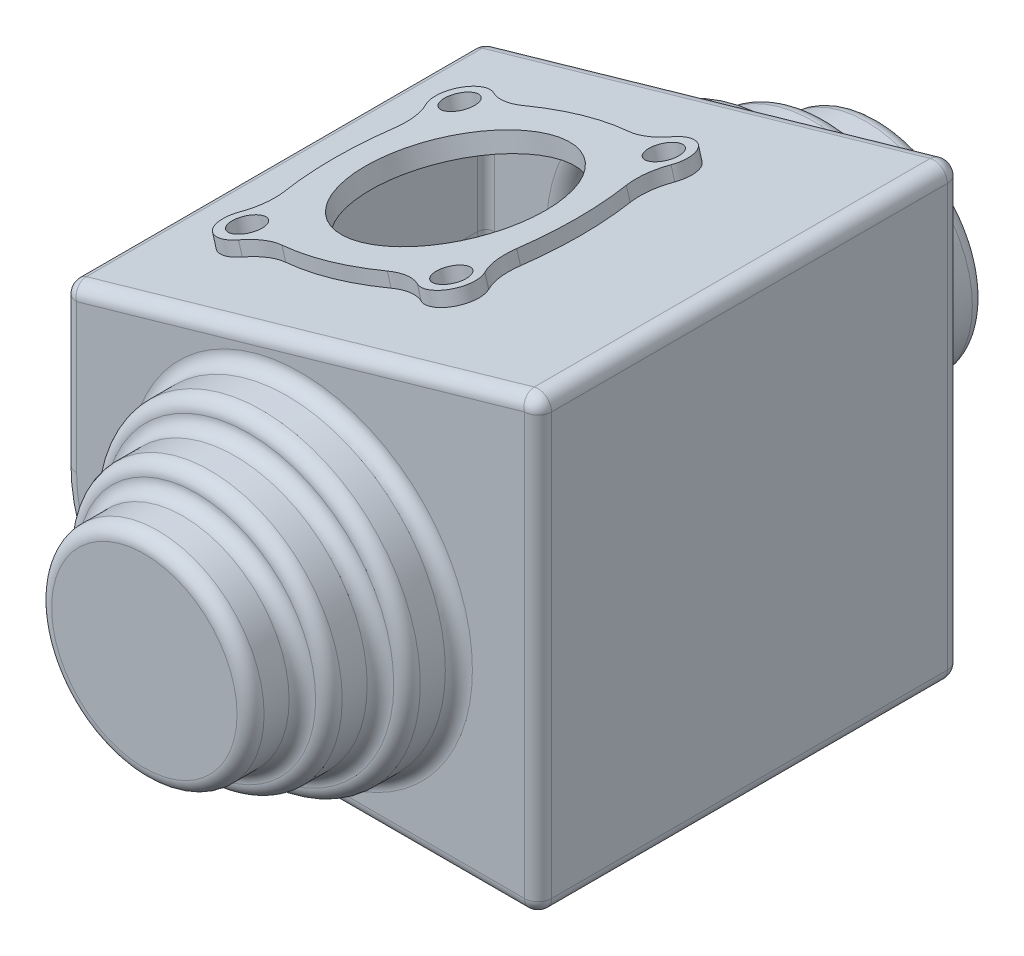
ISO-10303-21;
HEADER;
FILE_DESCRIPTION(('STEP AP214'),'2;1');
FILE_NAME('part.step','',(''),(''),'','','');
FILE_SCHEMA(('AUTOMOTIVE_DESIGN { 1 0 10303 214 1 1 1 1 }'));
ENDSEC;
DATA;
#1=APPLICATION_CONTEXT('core data for automotive mechanical design processes');
#2=APPLICATION_PROTOCOL_DEFINITION('international standard','automotive_design',2000,#1);
#3=PRODUCT_CONTEXT('',#1,'mechanical');
#4=PRODUCT('Part','Part','',(#3));
#5=PRODUCT_RELATED_PRODUCT_CATEGORY('part','',(#4));
#6=PRODUCT_DEFINITION_FORMATION('','',#4);
#7=PRODUCT_DEFINITION_CONTEXT('part definition',#1,'design');
#8=PRODUCT_DEFINITION('design','',#6,#7);
#9=PRODUCT_DEFINITION_SHAPE('','',#8);
#10=(LENGTH_UNIT() NAMED_UNIT(*) SI_UNIT(.MILLI.,.METRE.));
#11=(NAMED_UNIT(*) PLANE_ANGLE_UNIT() SI_UNIT($,.RADIAN.));
#12=(NAMED_UNIT(*) SI_UNIT($,.STERADIAN.) SOLID_ANGLE_UNIT());
#13=UNCERTAINTY_MEASURE_WITH_UNIT(LENGTH_MEASURE(1.E-05),#10,'distance_accuracy_value','');
#14=(GEOMETRIC_REPRESENTATION_CONTEXT(3) GLOBAL_UNCERTAINTY_ASSIGNED_CONTEXT((#13)) GLOBAL_UNIT_ASSIGNED_CONTEXT((#10,
#11,#12)) REPRESENTATION_CONTEXT('',''));
#15=CARTESIAN_POINT('',(0.,0.,0.));
#16=DIRECTION('',(0.,0.,1.));
#17=DIRECTION('',(1.,0.,0.));
#18=AXIS2_PLACEMENT_3D('',#15,#16,#17);
#19=CARTESIAN_POINT('',(114.,-89.,101.5));
#20=DIRECTION('',(-1.,0.,0.));
#21=DIRECTION('',(0.,0.,1.));
#22=AXIS2_PLACEMENT_3D('',#19,#20,#21);
#23=PLANE('',#22);
#24=DIRECTION('',(0.,1.,0.));
#25=VECTOR('',#24,1.);
#26=CARTESIAN_POINT('',(114.,-89.,-95.));
#27=LINE('',#26,#25);
#28=CARTESIAN_POINT('',(114.,-82.5,-95.));
#29=VERTEX_POINT('',#28);
#30=CARTESIAN_POINT('',(114.,119.752156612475,-95.));
#31=VERTEX_POINT('',#30);
#32=EDGE_CURVE('E455',#29,#31,#27,.T.);
#33=ORIENTED_EDGE('',*,*,#32,.T.);
#34=DIRECTION('',(0.,0.,-1.));
#35=VECTOR('',#34,1.);
#36=CARTESIAN_POINT('',(114.,119.752156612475,101.5));
#37=LINE('',#36,#35);
#38=CARTESIAN_POINT('',(114.,119.752156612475,95.));
#39=VERTEX_POINT('',#38);
#40=EDGE_CURVE('E458',#31,#39,#37,.F.);
#41=ORIENTED_EDGE('',*,*,#40,.T.);
#42=DIRECTION('',(0.,1.,0.));
#43=VECTOR('',#42,1.);
#44=CARTESIAN_POINT('',(114.,-89.,95.));
#45=LINE('',#44,#43);
#46=CARTESIAN_POINT('',(114.,-82.5,95.));
#47=VERTEX_POINT('',#46);
#48=EDGE_CURVE('E453',#39,#47,#45,.F.);
#49=ORIENTED_EDGE('',*,*,#48,.T.);
#50=DIRECTION('',(0.,0.,-1.));
#51=VECTOR('',#50,1.);
#52=CARTESIAN_POINT('',(114.,-82.5,101.5));
#53=LINE('',#52,#51);
#54=EDGE_CURVE('E451',#47,#29,#53,.T.);
#55=ORIENTED_EDGE('',*,*,#54,.T.);
#56=EDGE_LOOP('',(#33,#41,#49,#55));
#57=FACE_BOUND('',#56,.T.);
#58=ADVANCED_FACE('F33',(#57),#23,.F.);
#59=CARTESIAN_POINT('',(114.,128.377947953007,101.5));
#60=DIRECTION('',(0.275637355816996,-0.96126169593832,0.));
#61=DIRECTION('',(0.96126169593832,0.275637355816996,0.));
#62=AXIS2_PLACEMENT_3D('',#59,#60,#61);
#63=PLANE('',#62);
#64=CARTESIAN_POINT('',(53.8969239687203,111.143668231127,-31.5));
#65=DIRECTION('',(0.275637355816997,-0.96126169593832,0.));
#66=DIRECTION('',(0.96126169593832,0.275637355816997,0.));
#67=AXIS2_PLACEMENT_3D('',#64,#65,#66);
#68=CIRCLE('',#67,25.);
#69=CARTESIAN_POINT('',(30.3870871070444,104.4023309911,-26.3190789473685));
#70=VERTEX_POINT('',#69);
#71=CARTESIAN_POINT('',(33.4737531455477,105.287418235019,-44.6756756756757));
#72=VERTEX_POINT('',#71);
#73=EDGE_CURVE('E339',#70,#72,#68,.T.);
#74=ORIENTED_EDGE('',*,*,#73,.F.);
#75=CARTESIAN_POINT('',(-89.042884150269,70.1563378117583,0.));
#76=DIRECTION('',(-0.275637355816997,0.96126169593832,0.));
#77=DIRECTION('',(0.96126169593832,0.275637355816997,0.));
#78=AXIS2_PLACEMENT_3D('',#75,#76,#77);
#79=CIRCLE('',#78,127.);
#80=CARTESIAN_POINT('',(30.3870871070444,104.4023309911,26.3190789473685));
#81=VERTEX_POINT('',#80);
#82=EDGE_CURVE('E336',#81,#70,#79,.T.);
#83=ORIENTED_EDGE('',*,*,#82,.F.);
#84=CARTESIAN_POINT('',(53.8969239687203,111.143668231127,31.5));
#85=DIRECTION('',(0.275637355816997,-0.96126169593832,0.));
#86=DIRECTION('',(-0.96126169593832,-0.275637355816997,0.));
#87=AXIS2_PLACEMENT_3D('',#84,#85,#86);
#88=CIRCLE('',#87,25.);
#89=CARTESIAN_POINT('',(33.4737531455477,105.287418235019,44.6756756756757));
#90=VERTEX_POINT('',#89);
#91=EDGE_CURVE('E1855',#90,#81,#88,.T.);
#92=ORIENTED_EDGE('',*,*,#91,.F.);
#93=CARTESIAN_POINT('',(23.6706311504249,102.476418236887,51.));
#94=DIRECTION('',(-0.275637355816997,0.96126169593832,0.));
#95=DIRECTION('',(0.96126169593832,0.275637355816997,0.));
#96=AXIS2_PLACEMENT_3D('',#93,#94,#95);
#97=CIRCLE('',#96,12.);
#98=CARTESIAN_POINT('',(17.5913004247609,100.733198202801,61.1981822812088));
#99=VERTEX_POINT('',#98);
#100=EDGE_CURVE('E1852',#99,#90,#97,.T.);
#101=ORIENTED_EDGE('',*,*,#100,.F.);
#102=CARTESIAN_POINT('',(4.92602807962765,97.1014897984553,82.4443953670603));
#103=DIRECTION('',(0.275637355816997,-0.96126169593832,0.));
#104=DIRECTION('',(0.96126169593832,0.275637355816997,0.));
#105=AXIS2_PLACEMENT_3D('',#102,#103,#104);
#106=CIRCLE('',#105,25.);
#107=CARTESIAN_POINT('',(-0.0541928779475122,95.6734344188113,57.9871253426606));
#108=VERTEX_POINT('',#107);
#109=EDGE_CURVE('E1849',#108,#99,#106,.T.);
#110=ORIENTED_EDGE('',*,*,#109,.F.);
#111=CARTESIAN_POINT('',(-25.3537153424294,88.4189130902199,-66.2558063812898));
#112=DIRECTION('',(-0.275637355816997,0.96126169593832,0.));
#113=DIRECTION('',(0.96126169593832,0.275637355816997,0.));
#114=AXIS2_PLACEMENT_3D('',#111,#112,#113);
#115=CIRCLE('',#114,127.);
#116=CARTESIAN_POINT('',(-50.6532378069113,81.1643917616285,57.9871253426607));
#117=VERTEX_POINT('',#116);
#118=EDGE_CURVE('E1846',#117,#108,#115,.T.);
#119=ORIENTED_EDGE('',*,*,#118,.F.);
#120=CARTESIAN_POINT('',(-55.6334587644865,79.7363363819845,82.4443953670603));
#121=DIRECTION('',(0.275637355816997,-0.96126169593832,0.));
#122=DIRECTION('',(-0.96126169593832,-0.275637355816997,0.));
#123=AXIS2_PLACEMENT_3D('',#120,#121,#122);
#124=CIRCLE('',#123,25.);
#125=CARTESIAN_POINT('',(-68.2987311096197,76.104627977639,61.1981822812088));
#126=VERTEX_POINT('',#125);
#127=EDGE_CURVE('E1843',#126,#117,#124,.T.);
#128=ORIENTED_EDGE('',*,*,#127,.F.);
#129=CARTESIAN_POINT('',(-74.3780618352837,74.3614079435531,51.));
#130=DIRECTION('',(-0.275637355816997,0.96126169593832,0.));
#131=DIRECTION('',(-0.96126169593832,-0.275637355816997,0.));
#132=AXIS2_PLACEMENT_3D('',#129,#130,#131);
#133=CIRCLE('',#132,12.);
#134=CARTESIAN_POINT('',(-84.1811838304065,71.550407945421,44.6756756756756));
#135=VERTEX_POINT('',#134);
#136=EDGE_CURVE('E1840',#135,#126,#133,.T.);
#137=ORIENTED_EDGE('',*,*,#136,.F.);
#138=CARTESIAN_POINT('',(-104.604354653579,65.6941579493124,31.5));
#139=DIRECTION('',(0.275637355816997,-0.96126169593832,0.));
#140=DIRECTION('',(0.96126169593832,0.275637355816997,0.));
#141=AXIS2_PLACEMENT_3D('',#138,#139,#140);
#142=CIRCLE('',#141,25.);
#143=CARTESIAN_POINT('',(-81.0945177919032,72.4354951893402,26.3190789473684));
#144=VERTEX_POINT('',#143);
#145=EDGE_CURVE('E1837',#144,#135,#142,.T.);
#146=ORIENTED_EDGE('',*,*,#145,.F.);
#147=CARTESIAN_POINT('',(38.3354534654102,106.681488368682,0.));
#148=DIRECTION('',(-0.275637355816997,0.96126169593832,0.));
#149=DIRECTION('',(-0.96126169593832,-0.275637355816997,0.));
#150=AXIS2_PLACEMENT_3D('',#147,#148,#149);
#151=CIRCLE('',#150,127.);
#152=CARTESIAN_POINT('',(-81.0945177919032,72.4354951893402,-26.3190789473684));
#153=VERTEX_POINT('',#152);
#154=EDGE_CURVE('E1834',#153,#144,#151,.T.);
#155=ORIENTED_EDGE('',*,*,#154,.F.);
#156=CARTESIAN_POINT('',(-104.604354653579,65.6941579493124,-31.5));
#157=DIRECTION('',(0.275637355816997,-0.96126169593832,0.));
#158=DIRECTION('',(-0.96126169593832,-0.275637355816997,0.));
#159=AXIS2_PLACEMENT_3D('',#156,#157,#158);
#160=CIRCLE('',#159,25.);
#161=CARTESIAN_POINT('',(-84.1811838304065,71.550407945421,-44.6756756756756));
#162=VERTEX_POINT('',#161);
#163=EDGE_CURVE('E1831',#162,#153,#160,.T.);
#164=ORIENTED_EDGE('',*,*,#163,.F.);
#165=CARTESIAN_POINT('',(-74.3780618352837,74.3614079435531,-51.));
#166=DIRECTION('',(-0.275637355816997,0.96126169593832,0.));
#167=DIRECTION('',(0.96126169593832,0.275637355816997,0.));
#168=AXIS2_PLACEMENT_3D('',#165,#166,#167);
#169=CIRCLE('',#168,12.);
#170=CARTESIAN_POINT('',(-68.2987311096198,76.104627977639,-61.1981822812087));
#171=VERTEX_POINT('',#170);
#172=EDGE_CURVE('E1828',#171,#162,#169,.T.);
#173=ORIENTED_EDGE('',*,*,#172,.F.);
#174=CARTESIAN_POINT('',(-55.6334587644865,79.7363363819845,-82.4443953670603));
#175=DIRECTION('',(0.275637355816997,-0.96126169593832,0.));
#176=DIRECTION('',(0.96126169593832,0.275637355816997,0.));
#177=AXIS2_PLACEMENT_3D('',#174,#175,#176);
#178=CIRCLE('',#177,25.);
#179=CARTESIAN_POINT('',(-50.6532378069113,81.1643917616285,-57.9871253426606));
#180=VERTEX_POINT('',#179);
#181=EDGE_CURVE('E1825',#180,#171,#178,.T.);
#182=ORIENTED_EDGE('',*,*,#181,.F.);
#183=CARTESIAN_POINT('',(-25.3537153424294,88.4189130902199,66.2558063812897));
#184=DIRECTION('',(-0.275637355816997,0.96126169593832,0.));
#185=DIRECTION('',(-0.96126169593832,-0.275637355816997,0.));
#186=AXIS2_PLACEMENT_3D('',#183,#184,#185);
#187=CIRCLE('',#186,127.);
#188=CARTESIAN_POINT('',(-0.054192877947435,95.6734344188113,-57.9871253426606));
#189=VERTEX_POINT('',#188);
#190=EDGE_CURVE('E1822',#189,#180,#187,.T.);
#191=ORIENTED_EDGE('',*,*,#190,.F.);
#192=CARTESIAN_POINT('',(4.92602807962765,97.1014897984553,-82.4443953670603));
#193=DIRECTION('',(0.275637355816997,-0.96126169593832,0.));
#194=DIRECTION('',(-0.96126169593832,-0.275637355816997,0.));
#195=AXIS2_PLACEMENT_3D('',#192,#193,#194);
#196=CIRCLE('',#195,25.);
#197=CARTESIAN_POINT('',(17.5913004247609,100.733198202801,-61.1981822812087));
#198=VERTEX_POINT('',#197);
#199=EDGE_CURVE('E55',#198,#189,#196,.T.);
#200=ORIENTED_EDGE('',*,*,#199,.F.);
#201=CARTESIAN_POINT('',(23.6706311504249,102.476418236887,-51.));
#202=DIRECTION('',(-0.275637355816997,0.96126169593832,0.));
#203=DIRECTION('',(-0.96126169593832,-0.275637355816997,0.));
#204=AXIS2_PLACEMENT_3D('',#201,#202,#203);
#205=CIRCLE('',#204,12.);
#206=EDGE_CURVE('E50',#72,#198,#205,.T.);
#207=ORIENTED_EDGE('',*,*,#206,.F.);
#208=EDGE_LOOP('',(#74,#83,#92,#101,#110,#119,#128,#137,#146,#155,#164,#173,#182,#191,#200,#207));
#209=FACE_BOUND('',#208,.T.);
#210=DIRECTION('',(-0.96126169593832,-0.275637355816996,0.));
#211=VECTOR('',#210,1.);
#212=CARTESIAN_POINT('',(114.,128.377947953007,-95.));
#213=LINE('',#212,#211);
#214=CARTESIAN_POINT('',(105.70835718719,126.000357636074,-95.));
#215=VERTEX_POINT('',#214);
#216=CARTESIAN_POINT('',(-109.29164281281,64.3500996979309,-95.));
#217=VERTEX_POINT('',#216);
#218=EDGE_CURVE('E416',#215,#217,#213,.T.);
#219=ORIENTED_EDGE('',*,*,#218,.T.);
#220=DIRECTION('',(0.,0.,-1.));
#221=VECTOR('',#220,1.);
#222=CARTESIAN_POINT('',(-109.29164281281,64.3500996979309,101.5));
#223=LINE('',#222,#221);
#224=CARTESIAN_POINT('',(-109.29164281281,64.3500996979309,95.));
#225=VERTEX_POINT('',#224);
#226=EDGE_CURVE('E419',#217,#225,#223,.F.);
#227=ORIENTED_EDGE('',*,*,#226,.T.);
#228=DIRECTION('',(-0.96126169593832,-0.275637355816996,0.));
#229=VECTOR('',#228,1.);
#230=CARTESIAN_POINT('',(114.,128.377947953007,95.));
#231=LINE('',#230,#229);
#232=CARTESIAN_POINT('',(105.70835718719,126.000357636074,95.));
#233=VERTEX_POINT('',#232);
#234=EDGE_CURVE('E414',#225,#233,#231,.F.);
#235=ORIENTED_EDGE('',*,*,#234,.T.);
#236=DIRECTION('',(0.,0.,-1.));
#237=VECTOR('',#236,1.);
#238=CARTESIAN_POINT('',(105.70835718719,126.000357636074,101.5));
#239=LINE('',#238,#237);
#240=EDGE_CURVE('E412',#233,#215,#239,.T.);
#241=ORIENTED_EDGE('',*,*,#240,.T.);
#242=EDGE_LOOP('',(#219,#227,#235,#241));
#243=FACE_BOUND('',#242,.T.);
#244=ADVANCED_FACE('F768',(#209,#243),#63,.F.);
#245=CARTESIAN_POINT('',(-114.,63.,101.5));
#246=DIRECTION('',(1.,0.,0.));
#247=DIRECTION('',(0.,1.,0.));
#248=AXIS2_PLACEMENT_3D('',#245,#246,#247);
#249=PLANE('',#248);
#250=DIRECTION('',(0.,0.,-1.));
#251=VECTOR('',#250,1.);
#252=CARTESIAN_POINT('',(-114.,58.1018986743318,101.5));
#253=LINE('',#252,#251);
#254=CARTESIAN_POINT('',(-114.,58.1018986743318,95.));
#255=VERTEX_POINT('',#254);
#256=CARTESIAN_POINT('',(-114.,58.1018986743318,-95.));
#257=VERTEX_POINT('',#256);
#258=EDGE_CURVE('E434',#255,#257,#253,.T.);
#259=ORIENTED_EDGE('',*,*,#258,.T.);
#260=DIRECTION('',(0.,-1.,0.));
#261=VECTOR('',#260,1.);
#262=CARTESIAN_POINT('',(-114.,63.,-95.));
#263=LINE('',#262,#261);
#264=CARTESIAN_POINT('',(-114.,-13.,-94.9999999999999));
#265=VERTEX_POINT('',#264);
#266=EDGE_CURVE('E438',#257,#265,#263,.T.);
#267=ORIENTED_EDGE('',*,*,#266,.T.);
#268=DIRECTION('',(0.,0.,-1.));
#269=VECTOR('',#268,1.);
#270=CARTESIAN_POINT('',(-114.,-13.,101.5));
#271=LINE('',#270,#269);
#272=CARTESIAN_POINT('',(-114.,-13.,95.));
#273=VERTEX_POINT('',#272);
#274=EDGE_CURVE('E351',#273,#265,#271,.T.);
#275=ORIENTED_EDGE('',*,*,#274,.F.);
#276=DIRECTION('',(0.,-1.,0.));
#277=VECTOR('',#276,1.);
#278=CARTESIAN_POINT('',(-114.,63.,95.));
#279=LINE('',#278,#277);
#280=EDGE_CURVE('E436',#273,#255,#279,.F.);
#281=ORIENTED_EDGE('',*,*,#280,.T.);
#282=EDGE_LOOP('',(#259,#267,#275,#281));
#283=FACE_BOUND('',#282,.T.);
#284=ADVANCED_FACE('F774',(#283),#249,.F.);
#285=CARTESIAN_POINT('',(-38.,-13.,101.5));
#286=DIRECTION('',(0.,0.,-1.));
#287=DIRECTION('',(-1.,0.,0.));
#288=AXIS2_PLACEMENT_3D('',#285,#286,#287);
#289=CYLINDRICAL_SURFACE('',#288,76.);
#290=ORIENTED_EDGE('',*,*,#274,.T.);
#291=CARTESIAN_POINT('',(-38.,-13.,-95.));
#292=DIRECTION('',(0.,0.,1.));
#293=DIRECTION('',(1.,0.,0.));
#294=AXIS2_PLACEMENT_3D('',#291,#292,#293);
#295=CIRCLE('',#294,76.);
#296=CARTESIAN_POINT('',(-38.,-89.,-94.9999999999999));
#297=VERTEX_POINT('',#296);
#298=EDGE_CURVE('E443',#265,#297,#295,.T.);
#299=ORIENTED_EDGE('',*,*,#298,.T.);
#300=DIRECTION('',(0.,0.,-1.));
#301=VECTOR('',#300,1.);
#302=CARTESIAN_POINT('',(-38.,-89.,101.5));
#303=LINE('',#302,#301);
#304=CARTESIAN_POINT('',(-38.,-89.,95.));
#305=VERTEX_POINT('',#304);
#306=EDGE_CURVE('E348',#305,#297,#303,.T.);
#307=ORIENTED_EDGE('',*,*,#306,.F.);
#308=CARTESIAN_POINT('',(-38.,-13.,95.));
#309=DIRECTION('',(0.,0.,1.));
#310=DIRECTION('',(1.,0.,0.));
#311=AXIS2_PLACEMENT_3D('',#308,#309,#310);
#312=CIRCLE('',#311,76.);
#313=EDGE_CURVE('E441',#305,#273,#312,.F.);
#314=ORIENTED_EDGE('',*,*,#313,.T.);
#315=EDGE_LOOP('',(#290,#299,#307,#314));
#316=FACE_BOUND('',#315,.T.);
#317=ADVANCED_FACE('F1540',(#316),#289,.T.);
#318=CARTESIAN_POINT('',(-38.,-89.,101.5));
#319=DIRECTION('',(0.,1.,0.));
#320=DIRECTION('',(0.,0.,1.));
#321=AXIS2_PLACEMENT_3D('',#318,#319,#320);
#322=PLANE('',#321);
#323=ORIENTED_EDGE('',*,*,#306,.T.);
#324=DIRECTION('',(1.,0.,0.));
#325=VECTOR('',#324,1.);
#326=CARTESIAN_POINT('',(-38.,-89.,-95.));
#327=LINE('',#326,#325);
#328=CARTESIAN_POINT('',(107.5,-89.,-95.));
#329=VERTEX_POINT('',#328);
#330=EDGE_CURVE('E449',#297,#329,#327,.T.);
#331=ORIENTED_EDGE('',*,*,#330,.T.);
#332=DIRECTION('',(0.,0.,-1.));
#333=VECTOR('',#332,1.);
#334=CARTESIAN_POINT('',(107.5,-89.,101.5));
#335=LINE('',#334,#333);
#336=CARTESIAN_POINT('',(107.5,-89.,95.));
#337=VERTEX_POINT('',#336);
#338=EDGE_CURVE('E445',#329,#337,#335,.F.);
#339=ORIENTED_EDGE('',*,*,#338,.T.);
#340=DIRECTION('',(1.,0.,0.));
#341=VECTOR('',#340,1.);
#342=CARTESIAN_POINT('',(-38.,-89.,95.));
#343=LINE('',#342,#341);
#344=EDGE_CURVE('E447',#337,#305,#343,.F.);
#345=ORIENTED_EDGE('',*,*,#344,.T.);
#346=EDGE_LOOP('',(#323,#331,#339,#345));
#347=FACE_BOUND('',#346,.T.);
#348=ADVANCED_FACE('F1530',(#347),#322,.F.);
#349=CARTESIAN_POINT('',(-38.,-13.,101.5));
#350=DIRECTION('',(0.,0.,1.));
#351=DIRECTION('',(1.,0.,0.));
#352=AXIS2_PLACEMENT_3D('',#349,#350,#351);
#353=PLANE('',#352);
#354=CARTESIAN_POINT('',(-38.,-13.,101.5));
#355=DIRECTION('',(0.,0.,1.));
#356=DIRECTION('',(1.,0.,0.));
#357=AXIS2_PLACEMENT_3D('',#354,#355,#356);
#358=CIRCLE('',#357,69.5);
#359=CARTESIAN_POINT('',(-107.5,-13.,101.5));
#360=VERTEX_POINT('',#359);
#361=CARTESIAN_POINT('',(-38.,-82.5,101.5));
#362=VERTEX_POINT('',#361);
#363=EDGE_CURVE('E473',#360,#362,#358,.T.);
#364=ORIENTED_EDGE('',*,*,#363,.T.);
#365=DIRECTION('',(1.,0.,0.));
#366=VECTOR('',#365,1.);
#367=CARTESIAN_POINT('',(114.,-82.5,101.5));
#368=LINE('',#367,#366);
#369=CARTESIAN_POINT('',(0.,-82.5,101.5));
#370=VERTEX_POINT('',#369);
#371=EDGE_CURVE('E475',#362,#370,#368,.T.);
#372=ORIENTED_EDGE('',*,*,#371,.T.);
#373=CARTESIAN_POINT('',(0.,0.,101.5));
#374=DIRECTION('',(0.,0.,1.));
#375=DIRECTION('',(1.,0.,0.));
#376=AXIS2_PLACEMENT_3D('',#373,#374,#375);
#377=CIRCLE('',#376,82.5);
#378=CARTESIAN_POINT('',(82.5,0.,101.5));
#379=VERTEX_POINT('',#378);
#380=EDGE_CURVE('E460',#370,#379,#377,.F.);
#381=ORIENTED_EDGE('',*,*,#380,.T.);
#382=CARTESIAN_POINT('',(0.,0.,101.5));
#383=DIRECTION('',(0.,0.,1.));
#384=DIRECTION('',(1.,0.,0.));
#385=AXIS2_PLACEMENT_3D('',#382,#383,#384);
#386=CIRCLE('',#385,82.5);
#387=EDGE_CURVE('E462',#379,#370,#386,.F.);
#388=ORIENTED_EDGE('',*,*,#387,.T.);
#389=DIRECTION('',(1.,0.,0.));
#390=VECTOR('',#389,1.);
#391=CARTESIAN_POINT('',(114.,-82.5,101.5));
#392=LINE('',#391,#390);
#393=CARTESIAN_POINT('',(107.5,-82.5,101.5));
#394=VERTEX_POINT('',#393);
#395=EDGE_CURVE('E465',#370,#394,#392,.T.);
#396=ORIENTED_EDGE('',*,*,#395,.T.);
#397=DIRECTION('',(0.,1.,0.));
#398=VECTOR('',#397,1.);
#399=CARTESIAN_POINT('',(107.5,128.377947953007,101.5));
#400=LINE('',#399,#398);
#401=CARTESIAN_POINT('',(107.5,119.752156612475,101.5));
#402=VERTEX_POINT('',#401);
#403=EDGE_CURVE('E467',#394,#402,#400,.T.);
#404=ORIENTED_EDGE('',*,*,#403,.T.);
#405=DIRECTION('',(-0.96126169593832,-0.275637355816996,0.));
#406=VECTOR('',#405,1.);
#407=CARTESIAN_POINT('',(-112.20835718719,56.7517989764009,101.5));
#408=LINE('',#407,#406);
#409=CARTESIAN_POINT('',(-107.5,58.1018986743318,101.5));
#410=VERTEX_POINT('',#409);
#411=EDGE_CURVE('E469',#402,#410,#408,.T.);
#412=ORIENTED_EDGE('',*,*,#411,.T.);
#413=DIRECTION('',(0.,-1.,0.));
#414=VECTOR('',#413,1.);
#415=CARTESIAN_POINT('',(-107.5,-13.,101.5));
#416=LINE('',#415,#414);
#417=EDGE_CURVE('E471',#410,#360,#416,.T.);
#418=ORIENTED_EDGE('',*,*,#417,.T.);
#419=EDGE_LOOP('',(#364,#372,#381,#388,#396,#404,#412,#418));
#420=FACE_BOUND('',#419,.T.);
#421=ADVANCED_FACE('F1520',(#420),#353,.T.);
#422=CARTESIAN_POINT('',(-38.,-13.,-101.5));
#423=DIRECTION('',(0.,0.,1.));
#424=DIRECTION('',(1.,0.,0.));
#425=AXIS2_PLACEMENT_3D('',#422,#423,#424);
#426=PLANE('',#425);
#427=CARTESIAN_POINT('',(-38.,-13.,-101.5));
#428=DIRECTION('',(0.,0.,1.));
#429=DIRECTION('',(1.,0.,0.));
#430=AXIS2_PLACEMENT_3D('',#427,#428,#429);
#431=CIRCLE('',#430,69.5);
#432=CARTESIAN_POINT('',(-38.,-82.5,-101.5));
#433=VERTEX_POINT('',#432);
#434=CARTESIAN_POINT('',(-107.5,-13.,-101.5));
#435=VERTEX_POINT('',#434);
#436=EDGE_CURVE('E430',#433,#435,#431,.F.);
#437=ORIENTED_EDGE('',*,*,#436,.T.);
#438=DIRECTION('',(0.,-1.,0.));
#439=VECTOR('',#438,1.);
#440=CARTESIAN_POINT('',(-107.5,-13.,-101.5));
#441=LINE('',#440,#439);
#442=CARTESIAN_POINT('',(-107.5,58.1018986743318,-101.5));
#443=VERTEX_POINT('',#442);
#444=EDGE_CURVE('E432',#435,#443,#441,.F.);
#445=ORIENTED_EDGE('',*,*,#444,.T.);
#446=DIRECTION('',(-0.96126169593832,-0.275637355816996,0.));
#447=VECTOR('',#446,1.);
#448=CARTESIAN_POINT('',(-62.1194615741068,71.1145586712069,-101.5));
#449=LINE('',#448,#447);
#450=CARTESIAN_POINT('',(107.5,119.752156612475,-101.5));
#451=VERTEX_POINT('',#450);
#452=EDGE_CURVE('E425',#443,#451,#449,.F.);
#453=ORIENTED_EDGE('',*,*,#452,.T.);
#454=DIRECTION('',(0.,1.,0.));
#455=VECTOR('',#454,1.);
#456=CARTESIAN_POINT('',(107.5,-13.,-101.5));
#457=LINE('',#456,#455);
#458=CARTESIAN_POINT('',(107.5,-82.5,-101.5));
#459=VERTEX_POINT('',#458);
#460=EDGE_CURVE('E421',#451,#459,#457,.F.);
#461=ORIENTED_EDGE('',*,*,#460,.T.);
#462=DIRECTION('',(1.,0.,0.));
#463=VECTOR('',#462,1.);
#464=CARTESIAN_POINT('',(-38.,-82.5,-101.5));
#465=LINE('',#464,#463);
#466=CARTESIAN_POINT('',(0.,-82.5,-101.5));
#467=VERTEX_POINT('',#466);
#468=EDGE_CURVE('E423',#459,#467,#465,.F.);
#469=ORIENTED_EDGE('',*,*,#468,.T.);
#470=CARTESIAN_POINT('',(0.,0.,-101.5));
#471=DIRECTION('',(0.,0.,1.));
#472=DIRECTION('',(1.,0.,0.));
#473=AXIS2_PLACEMENT_3D('',#470,#471,#472);
#474=CIRCLE('',#473,82.5);
#475=EDGE_CURVE('E355',#467,#467,#474,.T.);
#476=ORIENTED_EDGE('',*,*,#475,.T.);
#477=DIRECTION('',(1.,0.,0.));
#478=VECTOR('',#477,1.);
#479=CARTESIAN_POINT('',(-38.,-82.5,-101.5));
#480=LINE('',#479,#478);
#481=EDGE_CURVE('E428',#467,#433,#480,.F.);
#482=ORIENTED_EDGE('',*,*,#481,.T.);
#483=EDGE_LOOP('',(#437,#445,#453,#461,#469,#476,#482));
#484=FACE_BOUND('',#483,.T.);
#485=ADVANCED_FACE('F1508',(#484),#426,.F.);
#486=CARTESIAN_POINT('',(0.,0.,126.5));
#487=DIRECTION('',(0.,0.,-1.));
#488=DIRECTION('',(-1.,0.,0.));
#489=AXIS2_PLACEMENT_3D('',#486,#487,#488);
#490=CYLINDRICAL_SURFACE('',#489,76.);
#491=CARTESIAN_POINT('',(0.,0.,120.009618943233));
#492=DIRECTION('',(0.,0.,-1.));
#493=DIRECTION('',(-1.,0.,0.));
#494=AXIS2_PLACEMENT_3D('',#491,#492,#493);
#495=CIRCLE('',#494,76.);
#496=CARTESIAN_POINT('',(-76.,0.,120.009618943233));
#497=VERTEX_POINT('',#496);
#498=EDGE_CURVE('E409',#497,#497,#495,.T.);
#499=ORIENTED_EDGE('',*,*,#498,.T.);
#500=EDGE_LOOP('',(#499));
#501=FACE_BOUND('',#500,.T.);
#502=CARTESIAN_POINT('',(0.,0.,108.));
#503=DIRECTION('',(0.,0.,1.));
#504=DIRECTION('',(1.,0.,0.));
#505=AXIS2_PLACEMENT_3D('',#502,#503,#504);
#506=CIRCLE('',#505,76.);
#507=CARTESIAN_POINT('',(76.,0.,108.));
#508=VERTEX_POINT('',#507);
#509=EDGE_CURVE('E406',#508,#508,#506,.T.);
#510=ORIENTED_EDGE('',*,*,#509,.T.);
#511=EDGE_LOOP('',(#510));
#512=FACE_BOUND('',#511,.T.);
#513=ADVANCED_FACE('F1502',(#501,#512),#490,.T.);
#514=CARTESIAN_POINT('',(0.,0.,151.5));
#515=DIRECTION('',(0.,0.,-1.));
#516=DIRECTION('',(-1.,0.,0.));
#517=AXIS2_PLACEMENT_3D('',#514,#515,#516);
#518=CYLINDRICAL_SURFACE('',#517,63.5);
#519=CARTESIAN_POINT('',(0.,0.,133.));
#520=DIRECTION('',(0.,0.,1.));
#521=DIRECTION('',(1.,0.,0.));
#522=AXIS2_PLACEMENT_3D('',#519,#520,#521);
#523=CIRCLE('',#522,63.5);
#524=CARTESIAN_POINT('',(63.5,0.,133.));
#525=VERTEX_POINT('',#524);
#526=EDGE_CURVE('E400',#525,#525,#523,.T.);
#527=ORIENTED_EDGE('',*,*,#526,.T.);
#528=EDGE_LOOP('',(#527));
#529=FACE_BOUND('',#528,.T.);
#530=CARTESIAN_POINT('',(0.,0.,145.));
#531=DIRECTION('',(0.,0.,1.));
#532=DIRECTION('',(1.,0.,0.));
#533=AXIS2_PLACEMENT_3D('',#530,#531,#532);
#534=CIRCLE('',#533,63.5);
#535=CARTESIAN_POINT('',(63.5,0.,145.));
#536=VERTEX_POINT('',#535);
#537=EDGE_CURVE('E373',#536,#536,#534,.F.);
#538=ORIENTED_EDGE('',*,*,#537,.T.);
#539=EDGE_LOOP('',(#538));
#540=FACE_BOUND('',#539,.T.);
#541=ADVANCED_FACE('F1507',(#529,#540),#518,.T.);
#542=CARTESIAN_POINT('',(0.,0.,176.5));
#543=DIRECTION('',(0.,0.,-1.));
#544=DIRECTION('',(-1.,0.,0.));
#545=AXIS2_PLACEMENT_3D('',#542,#543,#544);
#546=CYLINDRICAL_SURFACE('',#545,51.);
#547=CARTESIAN_POINT('',(0.,0.,157.990381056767));
#548=DIRECTION('',(0.,0.,1.));
#549=DIRECTION('',(1.,0.,0.));
#550=AXIS2_PLACEMENT_3D('',#547,#548,#549);
#551=CIRCLE('',#550,51.);
#552=CARTESIAN_POINT('',(51.,0.,157.990381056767));
#553=VERTEX_POINT('',#552);
#554=EDGE_CURVE('E394',#553,#553,#551,.T.);
#555=ORIENTED_EDGE('',*,*,#554,.T.);
#556=EDGE_LOOP('',(#555));
#557=FACE_BOUND('',#556,.T.);
#558=CARTESIAN_POINT('',(0.,0.,170.));
#559=DIRECTION('',(0.,0.,1.));
#560=DIRECTION('',(1.,0.,0.));
#561=AXIS2_PLACEMENT_3D('',#558,#559,#560);
#562=CIRCLE('',#561,51.);
#563=CARTESIAN_POINT('',(51.,0.,170.));
#564=VERTEX_POINT('',#563);
#565=EDGE_CURVE('E391',#564,#564,#562,.F.);
#566=ORIENTED_EDGE('',*,*,#565,.T.);
#567=EDGE_LOOP('',(#566));
#568=FACE_BOUND('',#567,.T.);
#569=ADVANCED_FACE('F1582',(#557,#568),#546,.T.);
#570=CARTESIAN_POINT('',(0.,0.,176.5));
#571=DIRECTION('',(0.,0.,1.));
#572=DIRECTION('',(1.,0.,0.));
#573=AXIS2_PLACEMENT_3D('',#570,#571,#572);
#574=PLANE('',#573);
#575=CARTESIAN_POINT('',(0.,0.,176.5));
#576=DIRECTION('',(0.,0.,1.));
#577=DIRECTION('',(1.,0.,0.));
#578=AXIS2_PLACEMENT_3D('',#575,#576,#577);
#579=CIRCLE('',#578,44.5);
#580=CARTESIAN_POINT('',(44.5,0.,176.5));
#581=VERTEX_POINT('',#580);
#582=EDGE_CURVE('E388',#581,#581,#579,.T.);
#583=ORIENTED_EDGE('',*,*,#582,.T.);
#584=EDGE_LOOP('',(#583));
#585=FACE_BOUND('',#584,.T.);
#586=ADVANCED_FACE('F1587',(#585),#574,.T.);
#587=CARTESIAN_POINT('',(0.,0.,-126.5));
#588=DIRECTION('',(0.,0.,1.));
#589=DIRECTION('',(1.,0.,0.));
#590=AXIS2_PLACEMENT_3D('',#587,#588,#589);
#591=CYLINDRICAL_SURFACE('',#590,76.);
#592=CARTESIAN_POINT('',(0.,0.,-120.009618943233));
#593=DIRECTION('',(0.,0.,-1.));
#594=DIRECTION('',(-1.,0.,0.));
#595=AXIS2_PLACEMENT_3D('',#592,#593,#594);
#596=CIRCLE('',#595,76.);
#597=CARTESIAN_POINT('',(-76.,0.,-120.009618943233));
#598=VERTEX_POINT('',#597);
#599=EDGE_CURVE('E376',#598,#598,#596,.F.);
#600=ORIENTED_EDGE('',*,*,#599,.T.);
#601=EDGE_LOOP('',(#600));
#602=FACE_BOUND('',#601,.T.);
#603=CARTESIAN_POINT('',(0.,0.,-108.));
#604=DIRECTION('',(0.,0.,1.));
#605=DIRECTION('',(1.,0.,0.));
#606=AXIS2_PLACEMENT_3D('',#603,#604,#605);
#607=CIRCLE('',#606,76.);
#608=CARTESIAN_POINT('',(76.,0.,-108.));
#609=VERTEX_POINT('',#608);
#610=EDGE_CURVE('E358',#609,#609,#607,.F.);
#611=ORIENTED_EDGE('',*,*,#610,.T.);
#612=EDGE_LOOP('',(#611));
#613=FACE_BOUND('',#612,.T.);
#614=ADVANCED_FACE('F1635',(#602,#613),#591,.T.);
#615=CARTESIAN_POINT('',(0.,0.,-151.5));
#616=DIRECTION('',(0.,0.,1.));
#617=DIRECTION('',(1.,0.,0.));
#618=AXIS2_PLACEMENT_3D('',#615,#616,#617);
#619=CYLINDRICAL_SURFACE('',#618,63.5);
#620=CARTESIAN_POINT('',(0.,0.,-145.009618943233));
#621=DIRECTION('',(0.,0.,-1.));
#622=DIRECTION('',(-1.,0.,0.));
#623=AXIS2_PLACEMENT_3D('',#620,#621,#622);
#624=CIRCLE('',#623,63.5);
#625=CARTESIAN_POINT('',(-63.5,0.,-145.009618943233));
#626=VERTEX_POINT('',#625);
#627=EDGE_CURVE('E382',#626,#626,#624,.F.);
#628=ORIENTED_EDGE('',*,*,#627,.T.);
#629=EDGE_LOOP('',(#628));
#630=FACE_BOUND('',#629,.T.);
#631=CARTESIAN_POINT('',(0.,0.,-133.));
#632=DIRECTION('',(0.,0.,-1.));
#633=DIRECTION('',(-1.,0.,0.));
#634=AXIS2_PLACEMENT_3D('',#631,#632,#633);
#635=CIRCLE('',#634,63.5);
#636=CARTESIAN_POINT('',(-63.5,0.,-133.));
#637=VERTEX_POINT('',#636);
#638=EDGE_CURVE('E367',#637,#637,#635,.T.);
#639=ORIENTED_EDGE('',*,*,#638,.T.);
#640=EDGE_LOOP('',(#639));
#641=FACE_BOUND('',#640,.T.);
#642=ADVANCED_FACE('F1629',(#630,#641),#619,.T.);
#643=CARTESIAN_POINT('',(0.,0.,-176.5));
#644=DIRECTION('',(0.,0.,1.));
#645=DIRECTION('',(1.,0.,0.));
#646=AXIS2_PLACEMENT_3D('',#643,#644,#645);
#647=CYLINDRICAL_SURFACE('',#646,51.);
#648=CARTESIAN_POINT('',(0.,0.,-158.));
#649=DIRECTION('',(0.,0.,-1.));
#650=DIRECTION('',(-1.,0.,0.));
#651=AXIS2_PLACEMENT_3D('',#648,#649,#650);
#652=CIRCLE('',#651,51.);
#653=CARTESIAN_POINT('',(-51.,0.,-158.));
#654=VERTEX_POINT('',#653);
#655=EDGE_CURVE('E364',#654,#654,#652,.T.);
#656=ORIENTED_EDGE('',*,*,#655,.T.);
#657=EDGE_LOOP('',(#656));
#658=FACE_BOUND('',#657,.T.);
#659=CARTESIAN_POINT('',(0.,0.,-170.));
#660=DIRECTION('',(0.,0.,-1.));
#661=DIRECTION('',(-1.,0.,0.));
#662=AXIS2_PLACEMENT_3D('',#659,#660,#661);
#663=CIRCLE('',#662,51.);
#664=CARTESIAN_POINT('',(-51.,0.,-170.));
#665=VERTEX_POINT('',#664);
#666=EDGE_CURVE('E361',#665,#665,#663,.F.);
#667=ORIENTED_EDGE('',*,*,#666,.T.);
#668=EDGE_LOOP('',(#667));
#669=FACE_BOUND('',#668,.T.);
#670=ADVANCED_FACE('F1634',(#658,#669),#647,.T.);
#671=CARTESIAN_POINT('',(0.,0.,-176.5));
#672=DIRECTION('',(0.,0.,-1.));
#673=DIRECTION('',(1.,0.,0.));
#674=AXIS2_PLACEMENT_3D('',#671,#672,#673);
#675=PLANE('',#674);
#676=CARTESIAN_POINT('',(0.,0.,-176.5));
#677=DIRECTION('',(0.,0.,-1.));
#678=DIRECTION('',(-1.,0.,0.));
#679=AXIS2_PLACEMENT_3D('',#676,#677,#678);
#680=CIRCLE('',#679,44.5);
#681=CARTESIAN_POINT('',(-44.5,0.,-176.5));
#682=VERTEX_POINT('',#681);
#683=EDGE_CURVE('E370',#682,#682,#680,.T.);
#684=ORIENTED_EDGE('',*,*,#683,.T.);
#685=EDGE_LOOP('',(#684));
#686=FACE_BOUND('',#685,.T.);
#687=ADVANCED_FACE('F782',(#686),#675,.T.);
#688=CARTESIAN_POINT('',(0.,0.,-108.));
#689=DIRECTION('',(0.,0.,1.));
#690=DIRECTION('',(1.,0.,0.));
#691=AXIS2_PLACEMENT_3D('',#688,#689,#690);
#692=TOROIDAL_SURFACE('',#691,82.5,6.5);
#693=ORIENTED_EDGE('',*,*,#610,.F.);
#694=EDGE_LOOP('',(#693));
#695=FACE_BOUND('',#694,.T.);
#696=ORIENTED_EDGE('',*,*,#475,.F.);
#697=EDGE_LOOP('',(#696));
#698=FACE_BOUND('',#697,.T.);
#699=ADVANCED_FACE('F778',(#695,#698),#692,.F.);
#700=CARTESIAN_POINT('',(0.,0.,-158.));
#701=DIRECTION('',(0.,0.,-1.));
#702=DIRECTION('',(-1.,0.,0.));
#703=AXIS2_PLACEMENT_3D('',#700,#701,#702);
#704=TOROIDAL_SURFACE('',#703,57.5,6.5);
#705=CARTESIAN_POINT('',(0.,0.,-151.504809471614));
#706=DIRECTION('',(0.,0.,-1.));
#707=DIRECTION('',(-1.,0.,0.));
#708=AXIS2_PLACEMENT_3D('',#705,#706,#707);
#709=CIRCLE('',#708,57.2499999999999);
#710=CARTESIAN_POINT('',(-57.2499999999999,0.,-151.504809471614));
#711=VERTEX_POINT('',#710);
#712=EDGE_CURVE('E385',#711,#711,#709,.T.);
#713=ORIENTED_EDGE('',*,*,#712,.T.);
#714=EDGE_LOOP('',(#713));
#715=FACE_BOUND('',#714,.T.);
#716=ORIENTED_EDGE('',*,*,#655,.F.);
#717=EDGE_LOOP('',(#716));
#718=FACE_BOUND('',#717,.T.);
#719=ADVANCED_FACE('F781',(#715,#718),#704,.F.);
#720=CARTESIAN_POINT('',(0.,0.,-133.));
#721=DIRECTION('',(0.,0.,-1.));
#722=DIRECTION('',(-1.,0.,0.));
#723=AXIS2_PLACEMENT_3D('',#720,#721,#722);
#724=TOROIDAL_SURFACE('',#723,70.,6.5);
#725=CARTESIAN_POINT('',(0.,0.,-126.504809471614));
#726=DIRECTION('',(0.,0.,-1.));
#727=DIRECTION('',(-1.,0.,0.));
#728=AXIS2_PLACEMENT_3D('',#725,#726,#727);
#729=CIRCLE('',#728,69.7499999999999);
#730=CARTESIAN_POINT('',(-69.7499999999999,0.,-126.504809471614));
#731=VERTEX_POINT('',#730);
#732=EDGE_CURVE('E379',#731,#731,#729,.T.);
#733=ORIENTED_EDGE('',*,*,#732,.T.);
#734=EDGE_LOOP('',(#733));
#735=FACE_BOUND('',#734,.T.);
#736=ORIENTED_EDGE('',*,*,#638,.F.);
#737=EDGE_LOOP('',(#736));
#738=FACE_BOUND('',#737,.T.);
#739=ADVANCED_FACE('F786',(#735,#738),#724,.F.);
#740=CARTESIAN_POINT('',(0.,0.,-170.));
#741=DIRECTION('',(0.,0.,-1.));
#742=DIRECTION('',(-1.,0.,0.));
#743=AXIS2_PLACEMENT_3D('',#740,#741,#742);
#744=TOROIDAL_SURFACE('',#743,44.5,6.5);
#745=ORIENTED_EDGE('',*,*,#683,.F.);
#746=EDGE_LOOP('',(#745));
#747=FACE_BOUND('',#746,.T.);
#748=ORIENTED_EDGE('',*,*,#666,.F.);
#749=EDGE_LOOP('',(#748));
#750=FACE_BOUND('',#749,.T.);
#751=ADVANCED_FACE('F790',(#747,#750),#744,.T.);
#752=CARTESIAN_POINT('',(0.,0.,145.));
#753=DIRECTION('',(0.,0.,1.));
#754=DIRECTION('',(1.,0.,0.));
#755=AXIS2_PLACEMENT_3D('',#752,#753,#754);
#756=TOROIDAL_SURFACE('',#755,57.,6.5);
#757=CARTESIAN_POINT('',(0.,0.,151.495190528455));
#758=DIRECTION('',(0.,0.,-1.));
#759=DIRECTION('',(-1.,0.,0.));
#760=AXIS2_PLACEMENT_3D('',#757,#758,#759);
#761=CIRCLE('',#760,57.2500000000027);
#762=CARTESIAN_POINT('',(-57.2500000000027,0.,151.495190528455));
#763=VERTEX_POINT('',#762);
#764=EDGE_CURVE('E397',#763,#763,#761,.T.);
#765=ORIENTED_EDGE('',*,*,#764,.T.);
#766=EDGE_LOOP('',(#765));
#767=FACE_BOUND('',#766,.T.);
#768=ORIENTED_EDGE('',*,*,#537,.F.);
#769=EDGE_LOOP('',(#768));
#770=FACE_BOUND('',#769,.T.);
#771=ADVANCED_FACE('F794',(#767,#770),#756,.T.);
#772=CARTESIAN_POINT('',(0.,0.,-120.009618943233));
#773=DIRECTION('',(0.,0.,-1.));
#774=DIRECTION('',(-1.,0.,0.));
#775=AXIS2_PLACEMENT_3D('',#772,#773,#774);
#776=TOROIDAL_SURFACE('',#775,69.5,6.5);
#777=ORIENTED_EDGE('',*,*,#732,.F.);
#778=EDGE_LOOP('',(#777));
#779=FACE_BOUND('',#778,.T.);
#780=ORIENTED_EDGE('',*,*,#599,.F.);
#781=EDGE_LOOP('',(#780));
#782=FACE_BOUND('',#781,.T.);
#783=ADVANCED_FACE('F798',(#779,#782),#776,.T.);
#784=CARTESIAN_POINT('',(0.,0.,-145.009618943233));
#785=DIRECTION('',(0.,0.,-1.));
#786=DIRECTION('',(-1.,0.,0.));
#787=AXIS2_PLACEMENT_3D('',#784,#785,#786);
#788=TOROIDAL_SURFACE('',#787,57.,6.5);
#789=ORIENTED_EDGE('',*,*,#712,.F.);
#790=EDGE_LOOP('',(#789));
#791=FACE_BOUND('',#790,.T.);
#792=ORIENTED_EDGE('',*,*,#627,.F.);
#793=EDGE_LOOP('',(#792));
#794=FACE_BOUND('',#793,.T.);
#795=ADVANCED_FACE('F802',(#791,#794),#788,.T.);
#796=CARTESIAN_POINT('',(0.,0.,170.));
#797=DIRECTION('',(0.,0.,1.));
#798=DIRECTION('',(1.,0.,0.));
#799=AXIS2_PLACEMENT_3D('',#796,#797,#798);
#800=TOROIDAL_SURFACE('',#799,44.5,6.5);
#801=ORIENTED_EDGE('',*,*,#565,.F.);
#802=EDGE_LOOP('',(#801));
#803=FACE_BOUND('',#802,.T.);
#804=ORIENTED_EDGE('',*,*,#582,.F.);
#805=EDGE_LOOP('',(#804));
#806=FACE_BOUND('',#805,.T.);
#807=ADVANCED_FACE('F806',(#803,#806),#800,.T.);
#808=CARTESIAN_POINT('',(0.,0.,157.990381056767));
#809=DIRECTION('',(0.,0.,1.));
#810=DIRECTION('',(1.,0.,0.));
#811=AXIS2_PLACEMENT_3D('',#808,#809,#810);
#812=TOROIDAL_SURFACE('',#811,57.5,6.5);
#813=ORIENTED_EDGE('',*,*,#764,.F.);
#814=EDGE_LOOP('',(#813));
#815=FACE_BOUND('',#814,.T.);
#816=ORIENTED_EDGE('',*,*,#554,.F.);
#817=EDGE_LOOP('',(#816));
#818=FACE_BOUND('',#817,.T.);
#819=ADVANCED_FACE('F810',(#815,#818),#812,.F.);
#820=CARTESIAN_POINT('',(0.,0.,133.));
#821=DIRECTION('',(0.,0.,1.));
#822=DIRECTION('',(1.,0.,0.));
#823=AXIS2_PLACEMENT_3D('',#820,#821,#822);
#824=TOROIDAL_SURFACE('',#823,70.,6.5);
#825=CARTESIAN_POINT('',(0.,0.,126.504809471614));
#826=DIRECTION('',(0.,0.,1.));
#827=DIRECTION('',(1.,0.,0.));
#828=AXIS2_PLACEMENT_3D('',#825,#826,#827);
#829=CIRCLE('',#828,69.7499999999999);
#830=CARTESIAN_POINT('',(69.7499999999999,0.,126.504809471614));
#831=VERTEX_POINT('',#830);
#832=EDGE_CURVE('E403',#831,#831,#829,.T.);
#833=ORIENTED_EDGE('',*,*,#832,.T.);
#834=EDGE_LOOP('',(#833));
#835=FACE_BOUND('',#834,.T.);
#836=ORIENTED_EDGE('',*,*,#526,.F.);
#837=EDGE_LOOP('',(#836));
#838=FACE_BOUND('',#837,.T.);
#839=ADVANCED_FACE('F814',(#835,#838),#824,.F.);
#840=CARTESIAN_POINT('',(0.,0.,120.009618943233));
#841=DIRECTION('',(0.,0.,-1.));
#842=DIRECTION('',(-1.,0.,0.));
#843=AXIS2_PLACEMENT_3D('',#840,#841,#842);
#844=TOROIDAL_SURFACE('',#843,69.5,6.5);
#845=ORIENTED_EDGE('',*,*,#498,.F.);
#846=EDGE_LOOP('',(#845));
#847=FACE_BOUND('',#846,.T.);
#848=ORIENTED_EDGE('',*,*,#832,.F.);
#849=EDGE_LOOP('',(#848));
#850=FACE_BOUND('',#849,.T.);
#851=ADVANCED_FACE('F818',(#847,#850),#844,.T.);
#852=CARTESIAN_POINT('',(-38.,-82.5,95.));
#853=DIRECTION('',(-1.,0.,0.));
#854=DIRECTION('',(0.,0.,1.));
#855=AXIS2_PLACEMENT_3D('',#852,#853,#854);
#856=CYLINDRICAL_SURFACE('',#855,6.5);
#857=CARTESIAN_POINT('',(107.5,-82.5,95.));
#858=DIRECTION('',(1.,0.,0.));
#859=DIRECTION('',(0.,0.,-1.));
#860=AXIS2_PLACEMENT_3D('',#857,#858,#859);
#861=CIRCLE('',#860,6.5);
#862=EDGE_CURVE('E352',#394,#337,#861,.T.);
#863=ORIENTED_EDGE('',*,*,#862,.F.);
#864=ORIENTED_EDGE('',*,*,#395,.F.);
#865=ORIENTED_EDGE('',*,*,#371,.F.);
#866=CARTESIAN_POINT('',(-38.,-82.5,95.));
#867=DIRECTION('',(-1.,0.,0.));
#868=DIRECTION('',(0.,0.,1.));
#869=AXIS2_PLACEMENT_3D('',#866,#867,#868);
#870=CIRCLE('',#869,6.5);
#871=EDGE_CURVE('E531',#305,#362,#870,.T.);
#872=ORIENTED_EDGE('',*,*,#871,.F.);
#873=ORIENTED_EDGE('',*,*,#344,.F.);
#874=EDGE_LOOP('',(#863,#864,#865,#872,#873));
#875=FACE_BOUND('',#874,.T.);
#876=ADVANCED_FACE('F822',(#875),#856,.T.);
#877=CARTESIAN_POINT('',(107.5,-82.5,95.));
#878=DIRECTION('',(0.,0.,1.));
#879=DIRECTION('',(1.,0.,0.));
#880=AXIS2_PLACEMENT_3D('',#877,#878,#879);
#881=SPHERICAL_SURFACE('',#880,6.5);
#882=CARTESIAN_POINT('',(107.5,-82.5,95.));
#883=DIRECTION('',(0.,-1.,0.));
#884=DIRECTION('',(0.,0.,-1.));
#885=AXIS2_PLACEMENT_3D('',#882,#883,#884);
#886=CIRCLE('',#885,6.5);
#887=EDGE_CURVE('E525',#394,#47,#886,.F.);
#888=ORIENTED_EDGE('',*,*,#887,.F.);
#889=ORIENTED_EDGE('',*,*,#862,.T.);
#890=CARTESIAN_POINT('',(107.5,-82.5,95.));
#891=DIRECTION('',(0.,0.,1.));
#892=DIRECTION('',(1.,0.,0.));
#893=AXIS2_PLACEMENT_3D('',#890,#891,#892);
#894=CIRCLE('',#893,6.5);
#895=EDGE_CURVE('E528',#47,#337,#894,.F.);
#896=ORIENTED_EDGE('',*,*,#895,.F.);
#897=EDGE_LOOP('',(#888,#889,#896));
#898=FACE_BOUND('',#897,.T.);
#899=ADVANCED_FACE('F892',(#898),#881,.T.);
#900=CARTESIAN_POINT('',(-38.,-13.,95.));
#901=DIRECTION('',(0.,0.,1.));
#902=DIRECTION('',(1.,0.,0.));
#903=AXIS2_PLACEMENT_3D('',#900,#901,#902);
#904=TOROIDAL_SURFACE('',#903,69.5,6.5);
#905=ORIENTED_EDGE('',*,*,#871,.T.);
#906=ORIENTED_EDGE('',*,*,#363,.F.);
#907=CARTESIAN_POINT('',(-107.5,-13.,95.));
#908=DIRECTION('',(0.,1.,0.));
#909=DIRECTION('',(0.,0.,1.));
#910=AXIS2_PLACEMENT_3D('',#907,#908,#909);
#911=CIRCLE('',#910,6.5);
#912=EDGE_CURVE('E522',#273,#360,#911,.T.);
#913=ORIENTED_EDGE('',*,*,#912,.F.);
#914=ORIENTED_EDGE('',*,*,#313,.F.);
#915=EDGE_LOOP('',(#905,#906,#913,#914));
#916=FACE_BOUND('',#915,.T.);
#917=ADVANCED_FACE('F888',(#916),#904,.T.);
#918=CARTESIAN_POINT('',(107.5,-82.5,101.5));
#919=DIRECTION('',(0.,0.,-1.));
#920=DIRECTION('',(-1.,0.,0.));
#921=AXIS2_PLACEMENT_3D('',#918,#919,#920);
#922=CYLINDRICAL_SURFACE('',#921,6.5);
#923=ORIENTED_EDGE('',*,*,#895,.T.);
#924=ORIENTED_EDGE('',*,*,#338,.F.);
#925=CARTESIAN_POINT('',(107.5,-82.5,-95.));
#926=DIRECTION('',(0.,0.,-1.));
#927=DIRECTION('',(-1.,0.,0.));
#928=AXIS2_PLACEMENT_3D('',#925,#926,#927);
#929=CIRCLE('',#928,6.5);
#930=EDGE_CURVE('E516',#29,#329,#929,.T.);
#931=ORIENTED_EDGE('',*,*,#930,.F.);
#932=ORIENTED_EDGE('',*,*,#54,.F.);
#933=EDGE_LOOP('',(#923,#924,#931,#932));
#934=FACE_BOUND('',#933,.T.);
#935=ADVANCED_FACE('F884',(#934),#922,.T.);
#936=CARTESIAN_POINT('',(107.5,-13.,95.));
#937=DIRECTION('',(0.,-1.,0.));
#938=DIRECTION('',(0.,0.,-1.));
#939=AXIS2_PLACEMENT_3D('',#936,#937,#938);
#940=CYLINDRICAL_SURFACE('',#939,6.5);
#941=ORIENTED_EDGE('',*,*,#887,.T.);
#942=ORIENTED_EDGE('',*,*,#48,.F.);
#943=CARTESIAN_POINT('',(107.5,119.752156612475,95.));
#944=DIRECTION('',(0.,1.,0.));
#945=DIRECTION('',(-1.,0.,0.));
#946=AXIS2_PLACEMENT_3D('',#943,#944,#945);
#947=CIRCLE('',#946,6.5);
#948=EDGE_CURVE('E513',#402,#39,#947,.T.);
#949=ORIENTED_EDGE('',*,*,#948,.F.);
#950=ORIENTED_EDGE('',*,*,#403,.F.);
#951=EDGE_LOOP('',(#941,#942,#949,#950));
#952=FACE_BOUND('',#951,.T.);
#953=ADVANCED_FACE('F880',(#952),#940,.T.);
#954=CARTESIAN_POINT('',(-62.1194615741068,71.1145586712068,95.));
#955=DIRECTION('',(0.96126169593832,0.275637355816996,0.));
#956=DIRECTION('',(-0.275637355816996,0.96126169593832,0.));
#957=AXIS2_PLACEMENT_3D('',#954,#955,#956);
#958=CYLINDRICAL_SURFACE('',#957,6.5);
#959=CARTESIAN_POINT('',(-107.5,58.1018986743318,95.));
#960=DIRECTION('',(-0.96126169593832,-0.275637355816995,0.));
#961=DIRECTION('',(0.275637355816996,-0.96126169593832,0.));
#962=AXIS2_PLACEMENT_3D('',#959,#960,#961);
#963=CIRCLE('',#962,6.5);
#964=EDGE_CURVE('E507',#410,#225,#963,.T.);
#965=ORIENTED_EDGE('',*,*,#964,.F.);
#966=ORIENTED_EDGE('',*,*,#411,.F.);
#967=CARTESIAN_POINT('',(107.5,119.752156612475,95.));
#968=DIRECTION('',(0.961261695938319,0.275637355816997,0.));
#969=DIRECTION('',(-0.275637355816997,0.96126169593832,0.));
#970=AXIS2_PLACEMENT_3D('',#967,#968,#969);
#971=CIRCLE('',#970,6.5);
#972=EDGE_CURVE('E510',#233,#402,#971,.T.);
#973=ORIENTED_EDGE('',*,*,#972,.F.);
#974=ORIENTED_EDGE('',*,*,#234,.F.);
#975=EDGE_LOOP('',(#965,#966,#973,#974));
#976=FACE_BOUND('',#975,.T.);
#977=ADVANCED_FACE('F876',(#976),#958,.T.);
#978=CARTESIAN_POINT('',(-107.5,-13.,95.));
#979=DIRECTION('',(0.,1.,0.));
#980=DIRECTION('',(-1.,0.,0.));
#981=AXIS2_PLACEMENT_3D('',#978,#979,#980);
#982=CYLINDRICAL_SURFACE('',#981,6.5);
#983=ORIENTED_EDGE('',*,*,#912,.T.);
#984=ORIENTED_EDGE('',*,*,#417,.F.);
#985=CARTESIAN_POINT('',(-107.5,58.1018986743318,95.));
#986=DIRECTION('',(0.,1.,0.));
#987=DIRECTION('',(0.,0.,1.));
#988=AXIS2_PLACEMENT_3D('',#985,#986,#987);
#989=CIRCLE('',#988,6.5);
#990=EDGE_CURVE('E504',#255,#410,#989,.T.);
#991=ORIENTED_EDGE('',*,*,#990,.F.);
#992=ORIENTED_EDGE('',*,*,#280,.F.);
#993=EDGE_LOOP('',(#983,#984,#991,#992));
#994=FACE_BOUND('',#993,.T.);
#995=ADVANCED_FACE('F872',(#994),#982,.T.);
#996=CARTESIAN_POINT('',(-38.,-82.5,-95.));
#997=DIRECTION('',(1.,0.,0.));
#998=DIRECTION('',(0.,0.,-1.));
#999=AXIS2_PLACEMENT_3D('',#996,#997,#998);
#1000=CYLINDRICAL_SURFACE('',#999,6.5);
#1001=CARTESIAN_POINT('',(107.5,-82.5,-95.));
#1002=DIRECTION('',(1.,0.,0.));
#1003=DIRECTION('',(0.,0.,-1.));
#1004=AXIS2_PLACEMENT_3D('',#1001,#1002,#1003);
#1005=CIRCLE('',#1004,6.5);
#1006=EDGE_CURVE('E519',#329,#459,#1005,.T.);
#1007=ORIENTED_EDGE('',*,*,#1006,.F.);
#1008=ORIENTED_EDGE('',*,*,#330,.F.);
#1009=CARTESIAN_POINT('',(-38.,-82.5,-95.));
#1010=DIRECTION('',(-1.,0.,0.));
#1011=DIRECTION('',(0.,0.,1.));
#1012=AXIS2_PLACEMENT_3D('',#1009,#1010,#1011);
#1013=CIRCLE('',#1012,6.5);
#1014=EDGE_CURVE('E501',#433,#297,#1013,.T.);
#1015=ORIENTED_EDGE('',*,*,#1014,.F.);
#1016=ORIENTED_EDGE('',*,*,#481,.F.);
#1017=ORIENTED_EDGE('',*,*,#468,.F.);
#1018=EDGE_LOOP('',(#1007,#1008,#1015,#1016,#1017));
#1019=FACE_BOUND('',#1018,.T.);
#1020=ADVANCED_FACE('F868',(#1019),#1000,.T.);
#1021=CARTESIAN_POINT('',(107.5,-82.5,-95.));
#1022=DIRECTION('',(0.,0.,1.));
#1023=DIRECTION('',(1.,0.,0.));
#1024=AXIS2_PLACEMENT_3D('',#1021,#1022,#1023);
#1025=SPHERICAL_SURFACE('',#1024,6.5);
#1026=ORIENTED_EDGE('',*,*,#930,.T.);
#1027=ORIENTED_EDGE('',*,*,#1006,.T.);
#1028=CARTESIAN_POINT('',(107.5,-82.5,-95.));
#1029=DIRECTION('',(0.,-1.,0.));
#1030=DIRECTION('',(0.,0.,-1.));
#1031=AXIS2_PLACEMENT_3D('',#1028,#1029,#1030);
#1032=CIRCLE('',#1031,6.5);
#1033=EDGE_CURVE('E498',#29,#459,#1032,.F.);
#1034=ORIENTED_EDGE('',*,*,#1033,.F.);
#1035=EDGE_LOOP('',(#1026,#1027,#1034));
#1036=FACE_BOUND('',#1035,.T.);
#1037=ADVANCED_FACE('F864',(#1036),#1025,.T.);
#1038=CARTESIAN_POINT('',(107.5,119.752156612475,95.));
#1039=DIRECTION('',(0.,0.,1.));
#1040=DIRECTION('',(1.,0.,0.));
#1041=AXIS2_PLACEMENT_3D('',#1038,#1039,#1040);
#1042=SPHERICAL_SURFACE('',#1041,6.5);
#1043=ORIENTED_EDGE('',*,*,#972,.T.);
#1044=ORIENTED_EDGE('',*,*,#948,.T.);
#1045=CARTESIAN_POINT('',(107.5,119.752156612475,95.));
#1046=DIRECTION('',(0.,0.,1.));
#1047=DIRECTION('',(1.,0.,0.));
#1048=AXIS2_PLACEMENT_3D('',#1045,#1046,#1047);
#1049=CIRCLE('',#1048,6.5);
#1050=EDGE_CURVE('E495',#233,#39,#1049,.F.);
#1051=ORIENTED_EDGE('',*,*,#1050,.F.);
#1052=EDGE_LOOP('',(#1043,#1044,#1051));
#1053=FACE_BOUND('',#1052,.T.);
#1054=ADVANCED_FACE('F860',(#1053),#1042,.T.);
#1055=CARTESIAN_POINT('',(-107.5,58.1018986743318,95.));
#1056=DIRECTION('',(0.,0.,1.));
#1057=DIRECTION('',(1.,0.,0.));
#1058=AXIS2_PLACEMENT_3D('',#1055,#1056,#1057);
#1059=SPHERICAL_SURFACE('',#1058,6.5);
#1060=ORIENTED_EDGE('',*,*,#990,.T.);
#1061=ORIENTED_EDGE('',*,*,#964,.T.);
#1062=CARTESIAN_POINT('',(-107.5,58.1018986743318,95.));
#1063=DIRECTION('',(0.,0.,1.));
#1064=DIRECTION('',(1.,0.,0.));
#1065=AXIS2_PLACEMENT_3D('',#1062,#1063,#1064);
#1066=CIRCLE('',#1065,6.5);
#1067=EDGE_CURVE('E492',#255,#225,#1066,.F.);
#1068=ORIENTED_EDGE('',*,*,#1067,.F.);
#1069=EDGE_LOOP('',(#1060,#1061,#1068));
#1070=FACE_BOUND('',#1069,.T.);
#1071=ADVANCED_FACE('F856',(#1070),#1059,.T.);
#1072=CARTESIAN_POINT('',(-38.,-13.,-95.));
#1073=DIRECTION('',(0.,0.,1.));
#1074=DIRECTION('',(1.,0.,0.));
#1075=AXIS2_PLACEMENT_3D('',#1072,#1073,#1074);
#1076=TOROIDAL_SURFACE('',#1075,69.5,6.5);
#1077=ORIENTED_EDGE('',*,*,#1014,.T.);
#1078=ORIENTED_EDGE('',*,*,#298,.F.);
#1079=CARTESIAN_POINT('',(-107.5,-13.,-95.));
#1080=DIRECTION('',(0.,1.,0.));
#1081=DIRECTION('',(-1.,0.,0.));
#1082=AXIS2_PLACEMENT_3D('',#1079,#1080,#1081);
#1083=CIRCLE('',#1082,6.5);
#1084=EDGE_CURVE('E490',#435,#265,#1083,.T.);
#1085=ORIENTED_EDGE('',*,*,#1084,.F.);
#1086=ORIENTED_EDGE('',*,*,#436,.F.);
#1087=EDGE_LOOP('',(#1077,#1078,#1085,#1086));
#1088=FACE_BOUND('',#1087,.T.);
#1089=ADVANCED_FACE('F852',(#1088),#1076,.T.);
#1090=CARTESIAN_POINT('',(107.5,-89.,-95.));
#1091=DIRECTION('',(0.,1.,0.));
#1092=DIRECTION('',(0.,0.,1.));
#1093=AXIS2_PLACEMENT_3D('',#1090,#1091,#1092);
#1094=CYLINDRICAL_SURFACE('',#1093,6.5);
#1095=ORIENTED_EDGE('',*,*,#1033,.T.);
#1096=ORIENTED_EDGE('',*,*,#460,.F.);
#1097=CARTESIAN_POINT('',(107.5,119.752156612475,-95.));
#1098=DIRECTION('',(0.,1.,0.));
#1099=DIRECTION('',(0.,0.,1.));
#1100=AXIS2_PLACEMENT_3D('',#1097,#1098,#1099);
#1101=CIRCLE('',#1100,6.5);
#1102=EDGE_CURVE('E487',#31,#451,#1101,.T.);
#1103=ORIENTED_EDGE('',*,*,#1102,.F.);
#1104=ORIENTED_EDGE('',*,*,#32,.F.);
#1105=EDGE_LOOP('',(#1095,#1096,#1103,#1104));
#1106=FACE_BOUND('',#1105,.T.);
#1107=ADVANCED_FACE('F848',(#1106),#1094,.T.);
#1108=CARTESIAN_POINT('',(107.5,119.752156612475,101.5));
#1109=DIRECTION('',(0.,0.,-1.));
#1110=DIRECTION('',(-1.,0.,0.));
#1111=AXIS2_PLACEMENT_3D('',#1108,#1109,#1110);
#1112=CYLINDRICAL_SURFACE('',#1111,6.5);
#1113=ORIENTED_EDGE('',*,*,#1050,.T.);
#1114=ORIENTED_EDGE('',*,*,#40,.F.);
#1115=CARTESIAN_POINT('',(107.5,119.752156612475,-95.));
#1116=DIRECTION('',(0.,0.,-1.));
#1117=DIRECTION('',(-1.,0.,0.));
#1118=AXIS2_PLACEMENT_3D('',#1115,#1116,#1117);
#1119=CIRCLE('',#1118,6.5);
#1120=EDGE_CURVE('E485',#215,#31,#1119,.T.);
#1121=ORIENTED_EDGE('',*,*,#1120,.F.);
#1122=ORIENTED_EDGE('',*,*,#240,.F.);
#1123=EDGE_LOOP('',(#1113,#1114,#1121,#1122));
#1124=FACE_BOUND('',#1123,.T.);
#1125=ADVANCED_FACE('F844',(#1124),#1112,.T.);
#1126=CARTESIAN_POINT('',(-107.5,58.1018986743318,101.5));
#1127=DIRECTION('',(0.,0.,-1.));
#1128=DIRECTION('',(-1.,0.,0.));
#1129=AXIS2_PLACEMENT_3D('',#1126,#1127,#1128);
#1130=CYLINDRICAL_SURFACE('',#1129,6.5);
#1131=ORIENTED_EDGE('',*,*,#1067,.T.);
#1132=ORIENTED_EDGE('',*,*,#226,.F.);
#1133=CARTESIAN_POINT('',(-107.5,58.1018986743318,-95.));
#1134=DIRECTION('',(0.,0.,-1.));
#1135=DIRECTION('',(-1.,0.,0.));
#1136=AXIS2_PLACEMENT_3D('',#1133,#1134,#1135);
#1137=CIRCLE('',#1136,6.5);
#1138=EDGE_CURVE('E482',#257,#217,#1137,.T.);
#1139=ORIENTED_EDGE('',*,*,#1138,.F.);
#1140=ORIENTED_EDGE('',*,*,#258,.F.);
#1141=EDGE_LOOP('',(#1131,#1132,#1139,#1140));
#1142=FACE_BOUND('',#1141,.T.);
#1143=ADVANCED_FACE('F840',(#1142),#1130,.T.);
#1144=CARTESIAN_POINT('',(-107.5,63.,-95.));
#1145=DIRECTION('',(0.,-1.,0.));
#1146=DIRECTION('',(1.,0.,0.));
#1147=AXIS2_PLACEMENT_3D('',#1144,#1145,#1146);
#1148=CYLINDRICAL_SURFACE('',#1147,6.5);
#1149=ORIENTED_EDGE('',*,*,#1084,.T.);
#1150=ORIENTED_EDGE('',*,*,#266,.F.);
#1151=CARTESIAN_POINT('',(-107.5,58.1018986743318,-95.));
#1152=DIRECTION('',(0.,1.,0.));
#1153=DIRECTION('',(-1.,0.,0.));
#1154=AXIS2_PLACEMENT_3D('',#1151,#1152,#1153);
#1155=CIRCLE('',#1154,6.5);
#1156=EDGE_CURVE('E479',#443,#257,#1155,.T.);
#1157=ORIENTED_EDGE('',*,*,#1156,.F.);
#1158=ORIENTED_EDGE('',*,*,#444,.F.);
#1159=EDGE_LOOP('',(#1149,#1150,#1157,#1158));
#1160=FACE_BOUND('',#1159,.T.);
#1161=ADVANCED_FACE('F836',(#1160),#1148,.T.);
#1162=CARTESIAN_POINT('',(107.5,119.752156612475,-95.));
#1163=DIRECTION('',(0.,0.,1.));
#1164=DIRECTION('',(1.,0.,0.));
#1165=AXIS2_PLACEMENT_3D('',#1162,#1163,#1164);
#1166=SPHERICAL_SURFACE('',#1165,6.5);
#1167=ORIENTED_EDGE('',*,*,#1120,.T.);
#1168=ORIENTED_EDGE('',*,*,#1102,.T.);
#1169=CARTESIAN_POINT('',(107.5,119.752156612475,-95.));
#1170=DIRECTION('',(0.961261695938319,0.275637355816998,0.));
#1171=DIRECTION('',(-0.275637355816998,0.961261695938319,0.));
#1172=AXIS2_PLACEMENT_3D('',#1169,#1170,#1171);
#1173=CIRCLE('',#1172,6.5);
#1174=EDGE_CURVE('E342',#215,#451,#1173,.F.);
#1175=ORIENTED_EDGE('',*,*,#1174,.F.);
#1176=EDGE_LOOP('',(#1167,#1168,#1175));
#1177=FACE_BOUND('',#1176,.T.);
#1178=ADVANCED_FACE('F832',(#1177),#1166,.T.);
#1179=CARTESIAN_POINT('',(-107.5,58.1018986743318,-95.));
#1180=DIRECTION('',(0.,0.,1.));
#1181=DIRECTION('',(1.,0.,0.));
#1182=AXIS2_PLACEMENT_3D('',#1179,#1180,#1181);
#1183=SPHERICAL_SURFACE('',#1182,6.5);
#1184=ORIENTED_EDGE('',*,*,#1156,.T.);
#1185=ORIENTED_EDGE('',*,*,#1138,.T.);
#1186=CARTESIAN_POINT('',(-107.5,58.1018986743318,-95.));
#1187=DIRECTION('',(-0.961261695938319,-0.275637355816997,0.));
#1188=DIRECTION('',(0.275637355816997,-0.96126169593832,0.));
#1189=AXIS2_PLACEMENT_3D('',#1186,#1187,#1188);
#1190=CIRCLE('',#1189,6.5);
#1191=EDGE_CURVE('E340',#443,#217,#1190,.F.);
#1192=ORIENTED_EDGE('',*,*,#1191,.F.);
#1193=EDGE_LOOP('',(#1184,#1185,#1192));
#1194=FACE_BOUND('',#1193,.T.);
#1195=ADVANCED_FACE('F828',(#1194),#1183,.T.);
#1196=CARTESIAN_POINT('',(115.79164281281,122.129746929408,-95.));
#1197=DIRECTION('',(-0.96126169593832,-0.275637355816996,0.));
#1198=DIRECTION('',(0.275637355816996,-0.96126169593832,0.));
#1199=AXIS2_PLACEMENT_3D('',#1196,#1197,#1198);
#1200=CYLINDRICAL_SURFACE('',#1199,6.5);
#1201=ORIENTED_EDGE('',*,*,#1174,.T.);
#1202=ORIENTED_EDGE('',*,*,#452,.F.);
#1203=ORIENTED_EDGE('',*,*,#1191,.T.);
#1204=ORIENTED_EDGE('',*,*,#218,.F.);
#1205=EDGE_LOOP('',(#1201,#1202,#1203,#1204));
#1206=FACE_BOUND('',#1205,.T.);
#1207=ADVANCED_FACE('F824',(#1206),#1200,.T.);
#1208=CARTESIAN_POINT('',(0.,0.,108.));
#1209=DIRECTION('',(0.,0.,1.));
#1210=DIRECTION('',(1.,0.,0.));
#1211=AXIS2_PLACEMENT_3D('',#1208,#1209,#1210);
#1212=TOROIDAL_SURFACE('',#1211,82.5,6.5);
#1213=ORIENTED_EDGE('',*,*,#380,.F.);
#1214=ORIENTED_EDGE('',*,*,#387,.F.);
#1215=EDGE_LOOP('',(#1213,#1214));
#1216=FACE_BOUND('',#1215,.T.);
#1217=ORIENTED_EDGE('',*,*,#509,.F.);
#1218=EDGE_LOOP('',(#1217));
#1219=FACE_BOUND('',#1218,.T.);
#1220=ADVANCED_FACE('F827',(#1216,#1219),#1212,.F.);
#1221=CARTESIAN_POINT('',(36.9921347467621,113.058244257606,-41.25));
#1222=DIRECTION('',(0.275637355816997,-0.96126169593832,0.));
#1223=DIRECTION('',(0.96126169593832,0.275637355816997,0.));
#1224=AXIS2_PLACEMENT_3D('',#1221,#1222,#1223);
#1225=PLANE('',#1224);
#1226=CARTESIAN_POINT('',(52.1052811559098,117.391869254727,-31.5));
#1227=DIRECTION('',(0.275637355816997,-0.96126169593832,0.));
#1228=DIRECTION('',(0.96126169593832,0.275637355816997,0.));
#1229=AXIS2_PLACEMENT_3D('',#1226,#1227,#1228);
#1230=CIRCLE('',#1229,25.);
#1231=CARTESIAN_POINT('',(28.5954442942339,110.650532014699,-26.3190789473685));
#1232=VERTEX_POINT('',#1231);
#1233=CARTESIAN_POINT('',(31.6821103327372,111.535619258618,-44.6756756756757));
#1234=VERTEX_POINT('',#1233);
#1235=EDGE_CURVE('E326',#1232,#1234,#1230,.T.);
#1236=ORIENTED_EDGE('',*,*,#1235,.T.);
#1237=CARTESIAN_POINT('',(21.8789883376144,108.724619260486,-51.));
#1238=DIRECTION('',(-0.275637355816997,0.96126169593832,0.));
#1239=DIRECTION('',(-0.96126169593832,-0.275637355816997,0.));
#1240=AXIS2_PLACEMENT_3D('',#1237,#1238,#1239);
#1241=CIRCLE('',#1240,12.);
#1242=CARTESIAN_POINT('',(15.7996576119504,106.9813992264,-61.1981822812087));
#1243=VERTEX_POINT('',#1242);
#1244=EDGE_CURVE('E315',#1234,#1243,#1241,.T.);
#1245=ORIENTED_EDGE('',*,*,#1244,.T.);
#1246=CARTESIAN_POINT('',(3.13438526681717,103.349690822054,-82.4443953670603));
#1247=DIRECTION('',(0.275637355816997,-0.96126169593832,0.));
#1248=DIRECTION('',(-0.96126169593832,-0.275637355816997,0.));
#1249=AXIS2_PLACEMENT_3D('',#1246,#1247,#1248);
#1250=CIRCLE('',#1249,25.);
#1251=CARTESIAN_POINT('',(-1.84583569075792,101.92163544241,-57.9871253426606));
#1252=VERTEX_POINT('',#1251);
#1253=EDGE_CURVE('E325',#1243,#1252,#1250,.T.);
#1254=ORIENTED_EDGE('',*,*,#1253,.T.);
#1255=CARTESIAN_POINT('',(-27.1453581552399,94.667114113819,66.2558063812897));
#1256=DIRECTION('',(-0.275637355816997,0.96126169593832,0.));
#1257=DIRECTION('',(-0.96126169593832,-0.275637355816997,0.));
#1258=AXIS2_PLACEMENT_3D('',#1255,#1256,#1257);
#1259=CIRCLE('',#1258,127.);
#1260=CARTESIAN_POINT('',(-52.4448806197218,87.4125927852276,-57.9871253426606));
#1261=VERTEX_POINT('',#1260);
#1262=EDGE_CURVE('E1793',#1252,#1261,#1259,.T.);
#1263=ORIENTED_EDGE('',*,*,#1262,.T.);
#1264=CARTESIAN_POINT('',(-57.425101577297,85.9845374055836,-82.4443953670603));
#1265=DIRECTION('',(0.275637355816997,-0.96126169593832,0.));
#1266=DIRECTION('',(0.96126169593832,0.275637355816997,0.));
#1267=AXIS2_PLACEMENT_3D('',#1264,#1265,#1266);
#1268=CIRCLE('',#1267,25.);
#1269=CARTESIAN_POINT('',(-70.0903739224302,82.352829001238,-61.1981822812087));
#1270=VERTEX_POINT('',#1269);
#1271=EDGE_CURVE('E1795',#1261,#1270,#1268,.T.);
#1272=ORIENTED_EDGE('',*,*,#1271,.T.);
#1273=CARTESIAN_POINT('',(-76.1697046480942,80.6096089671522,-51.));
#1274=DIRECTION('',(-0.275637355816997,0.96126169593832,0.));
#1275=DIRECTION('',(0.96126169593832,0.275637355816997,0.));
#1276=AXIS2_PLACEMENT_3D('',#1273,#1274,#1275);
#1277=CIRCLE('',#1276,12.);
#1278=CARTESIAN_POINT('',(-85.972826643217,77.7986089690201,-44.6756756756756));
#1279=VERTEX_POINT('',#1278);
#1280=EDGE_CURVE('E1797',#1270,#1279,#1277,.T.);
#1281=ORIENTED_EDGE('',*,*,#1280,.T.);
#1282=CARTESIAN_POINT('',(-106.39599746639,71.9423589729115,-31.5));
#1283=DIRECTION('',(0.275637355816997,-0.96126169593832,0.));
#1284=DIRECTION('',(-0.96126169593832,-0.275637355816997,0.));
#1285=AXIS2_PLACEMENT_3D('',#1282,#1283,#1284);
#1286=CIRCLE('',#1285,25.);
#1287=CARTESIAN_POINT('',(-82.8861606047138,78.6836962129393,-26.3190789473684));
#1288=VERTEX_POINT('',#1287);
#1289=EDGE_CURVE('E1799',#1279,#1288,#1286,.T.);
#1290=ORIENTED_EDGE('',*,*,#1289,.T.);
#1291=CARTESIAN_POINT('',(36.5438106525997,112.929689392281,0.));
#1292=DIRECTION('',(-0.275637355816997,0.96126169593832,0.));
#1293=DIRECTION('',(-0.96126169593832,-0.275637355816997,0.));
#1294=AXIS2_PLACEMENT_3D('',#1291,#1292,#1293);
#1295=CIRCLE('',#1294,127.);
#1296=CARTESIAN_POINT('',(-82.8861606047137,78.6836962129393,26.3190789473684));
#1297=VERTEX_POINT('',#1296);
#1298=EDGE_CURVE('E1801',#1288,#1297,#1295,.T.);
#1299=ORIENTED_EDGE('',*,*,#1298,.T.);
#1300=CARTESIAN_POINT('',(-106.39599746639,71.9423589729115,31.5));
#1301=DIRECTION('',(0.275637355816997,-0.96126169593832,0.));
#1302=DIRECTION('',(0.96126169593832,0.275637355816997,0.));
#1303=AXIS2_PLACEMENT_3D('',#1300,#1301,#1302);
#1304=CIRCLE('',#1303,25.);
#1305=CARTESIAN_POINT('',(-85.972826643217,77.7986089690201,44.6756756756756));
#1306=VERTEX_POINT('',#1305);
#1307=EDGE_CURVE('E1803',#1297,#1306,#1304,.T.);
#1308=ORIENTED_EDGE('',*,*,#1307,.T.);
#1309=CARTESIAN_POINT('',(-76.1697046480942,80.6096089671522,51.));
#1310=DIRECTION('',(-0.275637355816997,0.96126169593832,0.));
#1311=DIRECTION('',(-0.96126169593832,-0.275637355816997,0.));
#1312=AXIS2_PLACEMENT_3D('',#1309,#1310,#1311);
#1313=CIRCLE('',#1312,12.);
#1314=CARTESIAN_POINT('',(-70.0903739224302,82.352829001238,61.1981822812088));
#1315=VERTEX_POINT('',#1314);
#1316=EDGE_CURVE('E1805',#1306,#1315,#1313,.T.);
#1317=ORIENTED_EDGE('',*,*,#1316,.T.);
#1318=CARTESIAN_POINT('',(-57.425101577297,85.9845374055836,82.4443953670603));
#1319=DIRECTION('',(0.275637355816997,-0.96126169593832,0.));
#1320=DIRECTION('',(-0.96126169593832,-0.275637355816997,0.));
#1321=AXIS2_PLACEMENT_3D('',#1318,#1319,#1320);
#1322=CIRCLE('',#1321,25.);
#1323=CARTESIAN_POINT('',(-52.4448806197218,87.4125927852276,57.9871253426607));
#1324=VERTEX_POINT('',#1323);
#1325=EDGE_CURVE('E1807',#1315,#1324,#1322,.T.);
#1326=ORIENTED_EDGE('',*,*,#1325,.T.);
#1327=CARTESIAN_POINT('',(-27.1453581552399,94.667114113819,-66.2558063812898));
#1328=DIRECTION('',(-0.275637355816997,0.96126169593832,0.));
#1329=DIRECTION('',(0.96126169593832,0.275637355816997,0.));
#1330=AXIS2_PLACEMENT_3D('',#1327,#1328,#1329);
#1331=CIRCLE('',#1330,127.);
#1332=CARTESIAN_POINT('',(-1.845835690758,101.92163544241,57.9871253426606));
#1333=VERTEX_POINT('',#1332);
#1334=EDGE_CURVE('E1809',#1324,#1333,#1331,.T.);
#1335=ORIENTED_EDGE('',*,*,#1334,.T.);
#1336=CARTESIAN_POINT('',(3.13438526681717,103.349690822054,82.4443953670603));
#1337=DIRECTION('',(0.275637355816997,-0.96126169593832,0.));
#1338=DIRECTION('',(0.96126169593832,0.275637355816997,0.));
#1339=AXIS2_PLACEMENT_3D('',#1336,#1337,#1338);
#1340=CIRCLE('',#1339,25.);
#1341=CARTESIAN_POINT('',(15.7996576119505,106.9813992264,61.1981822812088));
#1342=VERTEX_POINT('',#1341);
#1343=EDGE_CURVE('E1811',#1333,#1342,#1340,.T.);
#1344=ORIENTED_EDGE('',*,*,#1343,.T.);
#1345=CARTESIAN_POINT('',(21.8789883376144,108.724619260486,51.));
#1346=DIRECTION('',(-0.275637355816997,0.96126169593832,0.));
#1347=DIRECTION('',(0.96126169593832,0.275637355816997,0.));
#1348=AXIS2_PLACEMENT_3D('',#1345,#1346,#1347);
#1349=CIRCLE('',#1348,12.);
#1350=CARTESIAN_POINT('',(31.6821103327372,111.535619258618,44.6756756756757));
#1351=VERTEX_POINT('',#1350);
#1352=EDGE_CURVE('E1813',#1342,#1351,#1349,.T.);
#1353=ORIENTED_EDGE('',*,*,#1352,.T.);
#1354=CARTESIAN_POINT('',(52.1052811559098,117.391869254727,31.5));
#1355=DIRECTION('',(0.275637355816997,-0.96126169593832,0.));
#1356=DIRECTION('',(-0.96126169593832,-0.275637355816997,0.));
#1357=AXIS2_PLACEMENT_3D('',#1354,#1355,#1356);
#1358=CIRCLE('',#1357,25.);
#1359=CARTESIAN_POINT('',(28.5954442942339,110.650532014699,26.3190789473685));
#1360=VERTEX_POINT('',#1359);
#1361=EDGE_CURVE('E1815',#1351,#1360,#1358,.T.);
#1362=ORIENTED_EDGE('',*,*,#1361,.T.);
#1363=CARTESIAN_POINT('',(-90.8345269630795,76.4045388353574,0.));
#1364=DIRECTION('',(-0.275637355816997,0.96126169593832,0.));
#1365=DIRECTION('',(0.96126169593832,0.275637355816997,0.));
#1366=AXIS2_PLACEMENT_3D('',#1363,#1364,#1365);
#1367=CIRCLE('',#1366,127.);
#1368=EDGE_CURVE('E332',#1360,#1232,#1367,.T.);
#1369=ORIENTED_EDGE('',*,*,#1368,.T.);
#1370=EDGE_LOOP('',(#1236,#1245,#1254,#1263,#1272,#1281,#1290,#1299,#1308,#1317,#1326,#1335,
#1344,#1353,#1362,#1369));
#1371=FACE_BOUND('',#1370,.T.);
#1372=CARTESIAN_POINT('',(-27.1453581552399,94.667114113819,0.));
#1373=DIRECTION('',(-0.275637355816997,0.96126169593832,0.));
#1374=DIRECTION('',(-0.96126169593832,-0.275637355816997,0.));
#1375=AXIS2_PLACEMENT_3D('',#1372,#1373,#1374);
#1376=CIRCLE('',#1375,45.);
#1377=CARTESIAN_POINT('',(-70.4021344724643,82.2634331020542,0.));
#1378=VERTEX_POINT('',#1377);
#1379=EDGE_CURVE('E1789',#1378,#1378,#1376,.T.);
#1380=ORIENTED_EDGE('',*,*,#1379,.F.);
#1381=EDGE_LOOP('',(#1380));
#1382=FACE_BOUND('',#1381,.T.);
#1383=CARTESIAN_POINT('',(21.8789883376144,108.724619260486,-51.));
#1384=DIRECTION('',(-0.275637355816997,0.96126169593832,0.));
#1385=DIRECTION('',(-0.96126169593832,-0.275637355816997,0.));
#1386=AXIS2_PLACEMENT_3D('',#1383,#1384,#1385);
#1387=CIRCLE('',#1386,7.50000000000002);
#1388=CARTESIAN_POINT('',(14.669525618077,106.657339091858,-51.));
#1389=VERTEX_POINT('',#1388);
#1390=EDGE_CURVE('E1786',#1389,#1389,#1387,.T.);
#1391=ORIENTED_EDGE('',*,*,#1390,.F.);
#1392=EDGE_LOOP('',(#1391));
#1393=FACE_BOUND('',#1392,.T.);
#1394=CARTESIAN_POINT('',(-76.1697046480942,80.6096089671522,-51.));
#1395=DIRECTION('',(-0.275637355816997,0.96126169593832,0.));
#1396=DIRECTION('',(-0.96126169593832,-0.275637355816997,0.));
#1397=AXIS2_PLACEMENT_3D('',#1394,#1395,#1396);
#1398=CIRCLE('',#1397,7.50000000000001);
#1399=CARTESIAN_POINT('',(-83.3791673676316,78.5423287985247,-51.));
#1400=VERTEX_POINT('',#1399);
#1401=EDGE_CURVE('E1783',#1400,#1400,#1398,.T.);
#1402=ORIENTED_EDGE('',*,*,#1401,.F.);
#1403=EDGE_LOOP('',(#1402));
#1404=FACE_BOUND('',#1403,.T.);
#1405=CARTESIAN_POINT('',(-76.1697046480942,80.6096089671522,51.));
#1406=DIRECTION('',(-0.275637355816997,0.96126169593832,0.));
#1407=DIRECTION('',(-0.96126169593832,-0.275637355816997,0.));
#1408=AXIS2_PLACEMENT_3D('',#1405,#1406,#1407);
#1409=CIRCLE('',#1408,7.50000000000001);
#1410=CARTESIAN_POINT('',(-83.3791673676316,78.5423287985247,51.));
#1411=VERTEX_POINT('',#1410);
#1412=EDGE_CURVE('E1780',#1411,#1411,#1409,.T.);
#1413=ORIENTED_EDGE('',*,*,#1412,.F.);
#1414=EDGE_LOOP('',(#1413));
#1415=FACE_BOUND('',#1414,.T.);
#1416=CARTESIAN_POINT('',(21.8789883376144,108.724619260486,51.));
#1417=DIRECTION('',(-0.275637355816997,0.96126169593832,0.));
#1418=DIRECTION('',(-0.96126169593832,-0.275637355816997,0.));
#1419=AXIS2_PLACEMENT_3D('',#1416,#1417,#1418);
#1420=CIRCLE('',#1419,7.50000000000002);
#1421=CARTESIAN_POINT('',(14.669525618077,106.657339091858,51.));
#1422=VERTEX_POINT('',#1421);
#1423=EDGE_CURVE('E1762',#1422,#1422,#1420,.T.);
#1424=ORIENTED_EDGE('',*,*,#1423,.F.);
#1425=EDGE_LOOP('',(#1424));
#1426=FACE_BOUND('',#1425,.T.);
#1427=ADVANCED_FACE('F329',(#1371,#1382,#1393,#1404,#1415,#1426),#1225,.F.);
#1428=CARTESIAN_POINT('',(52.1052811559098,117.391869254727,-31.5));
#1429=DIRECTION('',(0.275637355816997,-0.96126169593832,0.));
#1430=DIRECTION('',(0.96126169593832,0.275637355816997,0.));
#1431=AXIS2_PLACEMENT_3D('',#1428,#1429,#1430);
#1432=CYLINDRICAL_SURFACE('',#1431,25.);
#1433=ORIENTED_EDGE('',*,*,#73,.T.);
#1434=DIRECTION('',(0.275637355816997,-0.96126169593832,0.));
#1435=VECTOR('',#1434,1.);
#1436=CARTESIAN_POINT('',(31.6821103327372,111.535619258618,-44.6756756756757));
#1437=LINE('',#1436,#1435);
#1438=EDGE_CURVE('E319',#1234,#72,#1437,.T.);
#1439=ORIENTED_EDGE('',*,*,#1438,.F.);
#1440=ORIENTED_EDGE('',*,*,#1235,.F.);
#1441=DIRECTION('',(0.275637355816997,-0.96126169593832,0.));
#1442=VECTOR('',#1441,1.);
#1443=CARTESIAN_POINT('',(28.5954442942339,110.650532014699,-26.3190789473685));
#1444=LINE('',#1443,#1442);
#1445=EDGE_CURVE('E1818',#1232,#70,#1444,.T.);
#1446=ORIENTED_EDGE('',*,*,#1445,.T.);
#1447=EDGE_LOOP('',(#1433,#1439,#1440,#1446));
#1448=FACE_BOUND('',#1447,.T.);
#1449=ADVANCED_FACE('F338',(#1448),#1432,.F.);
#1450=CARTESIAN_POINT('',(21.8789883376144,108.724619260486,-51.));
#1451=DIRECTION('',(0.275637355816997,-0.96126169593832,0.));
#1452=DIRECTION('',(0.96126169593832,0.275637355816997,0.));
#1453=AXIS2_PLACEMENT_3D('',#1450,#1451,#1452);
#1454=CYLINDRICAL_SURFACE('',#1453,12.);
#1455=ORIENTED_EDGE('',*,*,#206,.T.);
#1456=DIRECTION('',(0.275637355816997,-0.96126169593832,0.));
#1457=VECTOR('',#1456,1.);
#1458=CARTESIAN_POINT('',(15.7996576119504,106.9813992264,-61.1981822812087));
#1459=LINE('',#1458,#1457);
#1460=EDGE_CURVE('E322',#1243,#198,#1459,.T.);
#1461=ORIENTED_EDGE('',*,*,#1460,.F.);
#1462=ORIENTED_EDGE('',*,*,#1244,.F.);
#1463=ORIENTED_EDGE('',*,*,#1438,.T.);
#1464=EDGE_LOOP('',(#1455,#1461,#1462,#1463));
#1465=FACE_BOUND('',#1464,.T.);
#1466=ADVANCED_FACE('F317',(#1465),#1454,.T.);
#1467=CARTESIAN_POINT('',(3.13438526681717,103.349690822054,-82.4443953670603));
#1468=DIRECTION('',(0.275637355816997,-0.96126169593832,0.));
#1469=DIRECTION('',(0.96126169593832,0.275637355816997,0.));
#1470=AXIS2_PLACEMENT_3D('',#1467,#1468,#1469);
#1471=CYLINDRICAL_SURFACE('',#1470,25.);
#1472=ORIENTED_EDGE('',*,*,#199,.T.);
#1473=DIRECTION('',(0.275637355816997,-0.96126169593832,0.));
#1474=VECTOR('',#1473,1.);
#1475=CARTESIAN_POINT('',(-1.84583569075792,101.92163544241,-57.9871253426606));
#1476=LINE('',#1475,#1474);
#1477=EDGE_CURVE('E344',#1252,#189,#1476,.T.);
#1478=ORIENTED_EDGE('',*,*,#1477,.F.);
#1479=ORIENTED_EDGE('',*,*,#1253,.F.);
#1480=ORIENTED_EDGE('',*,*,#1460,.T.);
#1481=EDGE_LOOP('',(#1472,#1478,#1479,#1480));
#1482=FACE_BOUND('',#1481,.T.);
#1483=ADVANCED_FACE('F1683',(#1482),#1471,.F.);
#1484=CARTESIAN_POINT('',(-27.1453581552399,94.667114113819,66.2558063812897));
#1485=DIRECTION('',(0.275637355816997,-0.96126169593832,0.));
#1486=DIRECTION('',(0.96126169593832,0.275637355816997,0.));
#1487=AXIS2_PLACEMENT_3D('',#1484,#1485,#1486);
#1488=CYLINDRICAL_SURFACE('',#1487,127.);
#1489=ORIENTED_EDGE('',*,*,#190,.T.);
#1490=DIRECTION('',(0.275637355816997,-0.96126169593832,0.));
#1491=VECTOR('',#1490,1.);
#1492=CARTESIAN_POINT('',(-52.4448806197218,87.4125927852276,-57.9871253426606));
#1493=LINE('',#1492,#1491);
#1494=EDGE_CURVE('E1894',#1261,#180,#1493,.T.);
#1495=ORIENTED_EDGE('',*,*,#1494,.F.);
#1496=ORIENTED_EDGE('',*,*,#1262,.F.);
#1497=ORIENTED_EDGE('',*,*,#1477,.T.);
#1498=EDGE_LOOP('',(#1489,#1495,#1496,#1497));
#1499=FACE_BOUND('',#1498,.T.);
#1500=ADVANCED_FACE('F1686',(#1499),#1488,.T.);
#1501=CARTESIAN_POINT('',(-57.425101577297,85.9845374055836,-82.4443953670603));
#1502=DIRECTION('',(0.275637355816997,-0.96126169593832,0.));
#1503=DIRECTION('',(0.96126169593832,0.275637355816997,0.));
#1504=AXIS2_PLACEMENT_3D('',#1501,#1502,#1503);
#1505=CYLINDRICAL_SURFACE('',#1504,25.);
#1506=ORIENTED_EDGE('',*,*,#181,.T.);
#1507=DIRECTION('',(0.275637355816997,-0.96126169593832,0.));
#1508=VECTOR('',#1507,1.);
#1509=CARTESIAN_POINT('',(-70.0903739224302,82.352829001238,-61.1981822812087));
#1510=LINE('',#1509,#1508);
#1511=EDGE_CURVE('E1891',#1270,#171,#1510,.T.);
#1512=ORIENTED_EDGE('',*,*,#1511,.F.);
#1513=ORIENTED_EDGE('',*,*,#1271,.F.);
#1514=ORIENTED_EDGE('',*,*,#1494,.T.);
#1515=EDGE_LOOP('',(#1506,#1512,#1513,#1514));
#1516=FACE_BOUND('',#1515,.T.);
#1517=ADVANCED_FACE('F1690',(#1516),#1505,.F.);
#1518=CARTESIAN_POINT('',(-76.1697046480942,80.6096089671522,-51.));
#1519=DIRECTION('',(0.275637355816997,-0.96126169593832,0.));
#1520=DIRECTION('',(0.96126169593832,0.275637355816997,0.));
#1521=AXIS2_PLACEMENT_3D('',#1518,#1519,#1520);
#1522=CYLINDRICAL_SURFACE('',#1521,12.);
#1523=ORIENTED_EDGE('',*,*,#172,.T.);
#1524=DIRECTION('',(0.275637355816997,-0.96126169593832,0.));
#1525=VECTOR('',#1524,1.);
#1526=CARTESIAN_POINT('',(-85.972826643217,77.7986089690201,-44.6756756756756));
#1527=LINE('',#1526,#1525);
#1528=EDGE_CURVE('E1888',#1279,#162,#1527,.T.);
#1529=ORIENTED_EDGE('',*,*,#1528,.F.);
#1530=ORIENTED_EDGE('',*,*,#1280,.F.);
#1531=ORIENTED_EDGE('',*,*,#1511,.T.);
#1532=EDGE_LOOP('',(#1523,#1529,#1530,#1531));
#1533=FACE_BOUND('',#1532,.T.);
#1534=ADVANCED_FACE('F1694',(#1533),#1522,.T.);
#1535=CARTESIAN_POINT('',(-106.39599746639,71.9423589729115,-31.5));
#1536=DIRECTION('',(0.275637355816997,-0.96126169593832,0.));
#1537=DIRECTION('',(0.96126169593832,0.275637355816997,0.));
#1538=AXIS2_PLACEMENT_3D('',#1535,#1536,#1537);
#1539=CYLINDRICAL_SURFACE('',#1538,25.);
#1540=ORIENTED_EDGE('',*,*,#163,.T.);
#1541=DIRECTION('',(0.275637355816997,-0.96126169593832,0.));
#1542=VECTOR('',#1541,1.);
#1543=CARTESIAN_POINT('',(-82.8861606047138,78.6836962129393,-26.3190789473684));
#1544=LINE('',#1543,#1542);
#1545=EDGE_CURVE('E1885',#1288,#153,#1544,.T.);
#1546=ORIENTED_EDGE('',*,*,#1545,.F.);
#1547=ORIENTED_EDGE('',*,*,#1289,.F.);
#1548=ORIENTED_EDGE('',*,*,#1528,.T.);
#1549=EDGE_LOOP('',(#1540,#1546,#1547,#1548));
#1550=FACE_BOUND('',#1549,.T.);
#1551=ADVANCED_FACE('F1698',(#1550),#1539,.F.);
#1552=CARTESIAN_POINT('',(36.5438106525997,112.929689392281,0.));
#1553=DIRECTION('',(0.275637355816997,-0.96126169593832,0.));
#1554=DIRECTION('',(0.96126169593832,0.275637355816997,0.));
#1555=AXIS2_PLACEMENT_3D('',#1552,#1553,#1554);
#1556=CYLINDRICAL_SURFACE('',#1555,127.);
#1557=ORIENTED_EDGE('',*,*,#154,.T.);
#1558=DIRECTION('',(0.275637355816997,-0.96126169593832,0.));
#1559=VECTOR('',#1558,1.);
#1560=CARTESIAN_POINT('',(-82.8861606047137,78.6836962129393,26.3190789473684));
#1561=LINE('',#1560,#1559);
#1562=EDGE_CURVE('E1882',#1297,#144,#1561,.T.);
#1563=ORIENTED_EDGE('',*,*,#1562,.F.);
#1564=ORIENTED_EDGE('',*,*,#1298,.F.);
#1565=ORIENTED_EDGE('',*,*,#1545,.T.);
#1566=EDGE_LOOP('',(#1557,#1563,#1564,#1565));
#1567=FACE_BOUND('',#1566,.T.);
#1568=ADVANCED_FACE('F1702',(#1567),#1556,.T.);
#1569=CARTESIAN_POINT('',(-106.39599746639,71.9423589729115,31.5));
#1570=DIRECTION('',(0.275637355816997,-0.96126169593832,0.));
#1571=DIRECTION('',(0.96126169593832,0.275637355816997,0.));
#1572=AXIS2_PLACEMENT_3D('',#1569,#1570,#1571);
#1573=CYLINDRICAL_SURFACE('',#1572,25.);
#1574=ORIENTED_EDGE('',*,*,#145,.T.);
#1575=DIRECTION('',(0.275637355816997,-0.96126169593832,0.));
#1576=VECTOR('',#1575,1.);
#1577=CARTESIAN_POINT('',(-85.972826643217,77.7986089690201,44.6756756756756));
#1578=LINE('',#1577,#1576);
#1579=EDGE_CURVE('E1879',#1306,#135,#1578,.T.);
#1580=ORIENTED_EDGE('',*,*,#1579,.F.);
#1581=ORIENTED_EDGE('',*,*,#1307,.F.);
#1582=ORIENTED_EDGE('',*,*,#1562,.T.);
#1583=EDGE_LOOP('',(#1574,#1580,#1581,#1582));
#1584=FACE_BOUND('',#1583,.T.);
#1585=ADVANCED_FACE('F1706',(#1584),#1573,.F.);
#1586=CARTESIAN_POINT('',(-76.1697046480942,80.6096089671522,51.));
#1587=DIRECTION('',(0.275637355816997,-0.96126169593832,0.));
#1588=DIRECTION('',(0.96126169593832,0.275637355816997,0.));
#1589=AXIS2_PLACEMENT_3D('',#1586,#1587,#1588);
#1590=CYLINDRICAL_SURFACE('',#1589,12.);
#1591=ORIENTED_EDGE('',*,*,#136,.T.);
#1592=DIRECTION('',(0.275637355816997,-0.96126169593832,0.));
#1593=VECTOR('',#1592,1.);
#1594=CARTESIAN_POINT('',(-70.0903739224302,82.352829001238,61.1981822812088));
#1595=LINE('',#1594,#1593);
#1596=EDGE_CURVE('E1876',#1315,#126,#1595,.T.);
#1597=ORIENTED_EDGE('',*,*,#1596,.F.);
#1598=ORIENTED_EDGE('',*,*,#1316,.F.);
#1599=ORIENTED_EDGE('',*,*,#1579,.T.);
#1600=EDGE_LOOP('',(#1591,#1597,#1598,#1599));
#1601=FACE_BOUND('',#1600,.T.);
#1602=ADVANCED_FACE('F1710',(#1601),#1590,.T.);
#1603=CARTESIAN_POINT('',(-57.425101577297,85.9845374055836,82.4443953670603));
#1604=DIRECTION('',(0.275637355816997,-0.96126169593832,0.));
#1605=DIRECTION('',(0.96126169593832,0.275637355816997,0.));
#1606=AXIS2_PLACEMENT_3D('',#1603,#1604,#1605);
#1607=CYLINDRICAL_SURFACE('',#1606,25.);
#1608=ORIENTED_EDGE('',*,*,#127,.T.);
#1609=DIRECTION('',(0.275637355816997,-0.96126169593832,0.));
#1610=VECTOR('',#1609,1.);
#1611=CARTESIAN_POINT('',(-52.4448806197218,87.4125927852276,57.9871253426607));
#1612=LINE('',#1611,#1610);
#1613=EDGE_CURVE('E1873',#1324,#117,#1612,.T.);
#1614=ORIENTED_EDGE('',*,*,#1613,.F.);
#1615=ORIENTED_EDGE('',*,*,#1325,.F.);
#1616=ORIENTED_EDGE('',*,*,#1596,.T.);
#1617=EDGE_LOOP('',(#1608,#1614,#1615,#1616));
#1618=FACE_BOUND('',#1617,.T.);
#1619=ADVANCED_FACE('F1714',(#1618),#1607,.F.);
#1620=CARTESIAN_POINT('',(-27.1453581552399,94.667114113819,-66.2558063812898));
#1621=DIRECTION('',(0.275637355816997,-0.96126169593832,0.));
#1622=DIRECTION('',(0.96126169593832,0.275637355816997,0.));
#1623=AXIS2_PLACEMENT_3D('',#1620,#1621,#1622);
#1624=CYLINDRICAL_SURFACE('',#1623,127.);
#1625=ORIENTED_EDGE('',*,*,#118,.T.);
#1626=DIRECTION('',(0.275637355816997,-0.96126169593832,0.));
#1627=VECTOR('',#1626,1.);
#1628=CARTESIAN_POINT('',(-1.845835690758,101.92163544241,57.9871253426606));
#1629=LINE('',#1628,#1627);
#1630=EDGE_CURVE('E1870',#1333,#108,#1629,.T.);
#1631=ORIENTED_EDGE('',*,*,#1630,.F.);
#1632=ORIENTED_EDGE('',*,*,#1334,.F.);
#1633=ORIENTED_EDGE('',*,*,#1613,.T.);
#1634=EDGE_LOOP('',(#1625,#1631,#1632,#1633));
#1635=FACE_BOUND('',#1634,.T.);
#1636=ADVANCED_FACE('F1718',(#1635),#1624,.T.);
#1637=CARTESIAN_POINT('',(3.13438526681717,103.349690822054,82.4443953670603));
#1638=DIRECTION('',(0.275637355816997,-0.96126169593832,0.));
#1639=DIRECTION('',(0.96126169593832,0.275637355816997,0.));
#1640=AXIS2_PLACEMENT_3D('',#1637,#1638,#1639);
#1641=CYLINDRICAL_SURFACE('',#1640,25.);
#1642=ORIENTED_EDGE('',*,*,#109,.T.);
#1643=DIRECTION('',(0.275637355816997,-0.96126169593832,0.));
#1644=VECTOR('',#1643,1.);
#1645=CARTESIAN_POINT('',(15.7996576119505,106.9813992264,61.1981822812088));
#1646=LINE('',#1645,#1644);
#1647=EDGE_CURVE('E1867',#1342,#99,#1646,.T.);
#1648=ORIENTED_EDGE('',*,*,#1647,.F.);
#1649=ORIENTED_EDGE('',*,*,#1343,.F.);
#1650=ORIENTED_EDGE('',*,*,#1630,.T.);
#1651=EDGE_LOOP('',(#1642,#1648,#1649,#1650));
#1652=FACE_BOUND('',#1651,.T.);
#1653=ADVANCED_FACE('F1722',(#1652),#1641,.F.);
#1654=CARTESIAN_POINT('',(21.8789883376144,108.724619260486,51.));
#1655=DIRECTION('',(0.275637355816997,-0.96126169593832,0.));
#1656=DIRECTION('',(0.96126169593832,0.275637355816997,0.));
#1657=AXIS2_PLACEMENT_3D('',#1654,#1655,#1656);
#1658=CYLINDRICAL_SURFACE('',#1657,12.);
#1659=ORIENTED_EDGE('',*,*,#100,.T.);
#1660=DIRECTION('',(0.275637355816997,-0.96126169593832,0.));
#1661=VECTOR('',#1660,1.);
#1662=CARTESIAN_POINT('',(31.6821103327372,111.535619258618,44.6756756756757));
#1663=LINE('',#1662,#1661);
#1664=EDGE_CURVE('E1864',#1351,#90,#1663,.T.);
#1665=ORIENTED_EDGE('',*,*,#1664,.F.);
#1666=ORIENTED_EDGE('',*,*,#1352,.F.);
#1667=ORIENTED_EDGE('',*,*,#1647,.T.);
#1668=EDGE_LOOP('',(#1659,#1665,#1666,#1667));
#1669=FACE_BOUND('',#1668,.T.);
#1670=ADVANCED_FACE('F1726',(#1669),#1658,.T.);
#1671=CARTESIAN_POINT('',(52.1052811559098,117.391869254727,31.5));
#1672=DIRECTION('',(0.275637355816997,-0.96126169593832,0.));
#1673=DIRECTION('',(0.96126169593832,0.275637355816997,0.));
#1674=AXIS2_PLACEMENT_3D('',#1671,#1672,#1673);
#1675=CYLINDRICAL_SURFACE('',#1674,25.);
#1676=ORIENTED_EDGE('',*,*,#91,.T.);
#1677=DIRECTION('',(0.275637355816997,-0.96126169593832,0.));
#1678=VECTOR('',#1677,1.);
#1679=CARTESIAN_POINT('',(28.5954442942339,110.650532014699,26.3190789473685));
#1680=LINE('',#1679,#1678);
#1681=EDGE_CURVE('E1861',#1360,#81,#1680,.T.);
#1682=ORIENTED_EDGE('',*,*,#1681,.F.);
#1683=ORIENTED_EDGE('',*,*,#1361,.F.);
#1684=ORIENTED_EDGE('',*,*,#1664,.T.);
#1685=EDGE_LOOP('',(#1676,#1682,#1683,#1684));
#1686=FACE_BOUND('',#1685,.T.);
#1687=ADVANCED_FACE('F1730',(#1686),#1675,.F.);
#1688=CARTESIAN_POINT('',(-90.8345269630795,76.4045388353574,0.));
#1689=DIRECTION('',(0.275637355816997,-0.96126169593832,0.));
#1690=DIRECTION('',(0.96126169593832,0.275637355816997,0.));
#1691=AXIS2_PLACEMENT_3D('',#1688,#1689,#1690);
#1692=CYLINDRICAL_SURFACE('',#1691,127.);
#1693=ORIENTED_EDGE('',*,*,#82,.T.);
#1694=ORIENTED_EDGE('',*,*,#1445,.F.);
#1695=ORIENTED_EDGE('',*,*,#1368,.F.);
#1696=ORIENTED_EDGE('',*,*,#1681,.T.);
#1697=EDGE_LOOP('',(#1693,#1694,#1695,#1696));
#1698=FACE_BOUND('',#1697,.T.);
#1699=ADVANCED_FACE('F1734',(#1698),#1692,.T.);
#1700=CARTESIAN_POINT('',(-27.1453581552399,94.667114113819,0.));
#1701=DIRECTION('',(0.275637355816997,-0.96126169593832,0.));
#1702=DIRECTION('',(0.96126169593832,0.275637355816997,0.));
#1703=AXIS2_PLACEMENT_3D('',#1700,#1701,#1702);
#1704=CYLINDRICAL_SURFACE('',#1703,45.);
#1705=ORIENTED_EDGE('',*,*,#1379,.T.);
#1706=EDGE_LOOP('',(#1705));
#1707=FACE_BOUND('',#1706,.T.);
#1708=CARTESIAN_POINT('',(-24.6646219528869,86.0157588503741,0.));
#1709=DIRECTION('',(0.275637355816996,-0.96126169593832,0.));
#1710=DIRECTION('',(0.96126169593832,0.275637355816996,0.));
#1711=AXIS2_PLACEMENT_3D('',#1708,#1709,#1710);
#1712=CIRCLE('',#1711,45.);
#1713=CARTESIAN_POINT('',(18.5921543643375,98.4194398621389,0.));
#1714=VERTEX_POINT('',#1713);
#1715=EDGE_CURVE('E1774',#1714,#1714,#1712,.F.);
#1716=ORIENTED_EDGE('',*,*,#1715,.F.);
#1717=EDGE_LOOP('',(#1716));
#1718=FACE_BOUND('',#1717,.T.);
#1719=ADVANCED_FACE('F1738',(#1707,#1718),#1704,.F.);
#1720=CARTESIAN_POINT('',(21.8789883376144,108.724619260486,-51.));
#1721=DIRECTION('',(0.275637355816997,-0.96126169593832,0.));
#1722=DIRECTION('',(0.96126169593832,0.275637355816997,0.));
#1723=AXIS2_PLACEMENT_3D('',#1720,#1721,#1722);
#1724=CYLINDRICAL_SURFACE('',#1723,7.50000000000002);
#1725=ORIENTED_EDGE('',*,*,#1390,.T.);
#1726=EDGE_LOOP('',(#1725));
#1727=FACE_BOUND('',#1726,.T.);
#1728=CARTESIAN_POINT('',(24.3597245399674,100.073263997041,-51.));
#1729=DIRECTION('',(0.275637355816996,-0.96126169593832,0.));
#1730=DIRECTION('',(0.96126169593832,0.275637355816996,0.));
#1731=AXIS2_PLACEMENT_3D('',#1728,#1729,#1730);
#1732=CIRCLE('',#1731,7.50000000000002);
#1733=CARTESIAN_POINT('',(31.5691872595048,102.140544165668,-51.));
#1734=VERTEX_POINT('',#1733);
#1735=EDGE_CURVE('E1768',#1734,#1734,#1732,.F.);
#1736=ORIENTED_EDGE('',*,*,#1735,.F.);
#1737=EDGE_LOOP('',(#1736));
#1738=FACE_BOUND('',#1737,.T.);
#1739=ADVANCED_FACE('F1743',(#1727,#1738),#1724,.F.);
#1740=CARTESIAN_POINT('',(-76.1697046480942,80.6096089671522,-51.));
#1741=DIRECTION('',(0.275637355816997,-0.96126169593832,0.));
#1742=DIRECTION('',(0.96126169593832,0.275637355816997,0.));
#1743=AXIS2_PLACEMENT_3D('',#1740,#1741,#1742);
#1744=CYLINDRICAL_SURFACE('',#1743,7.50000000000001);
#1745=ORIENTED_EDGE('',*,*,#1401,.T.);
#1746=EDGE_LOOP('',(#1745));
#1747=FACE_BOUND('',#1746,.T.);
#1748=CARTESIAN_POINT('',(-73.6889684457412,71.9582537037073,-51.));
#1749=DIRECTION('',(0.275637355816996,-0.96126169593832,0.));
#1750=DIRECTION('',(0.96126169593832,0.275637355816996,0.));
#1751=AXIS2_PLACEMENT_3D('',#1748,#1749,#1750);
#1752=CIRCLE('',#1751,7.5);
#1753=CARTESIAN_POINT('',(-66.4795057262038,74.0255338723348,-51.));
#1754=VERTEX_POINT('',#1753);
#1755=EDGE_CURVE('E1771',#1754,#1754,#1752,.F.);
#1756=ORIENTED_EDGE('',*,*,#1755,.F.);
#1757=EDGE_LOOP('',(#1756));
#1758=FACE_BOUND('',#1757,.T.);
#1759=ADVANCED_FACE('F1747',(#1747,#1758),#1744,.F.);
#1760=CARTESIAN_POINT('',(-76.1697046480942,80.6096089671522,51.));
#1761=DIRECTION('',(0.275637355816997,-0.96126169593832,0.));
#1762=DIRECTION('',(0.96126169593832,0.275637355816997,0.));
#1763=AXIS2_PLACEMENT_3D('',#1760,#1761,#1762);
#1764=CYLINDRICAL_SURFACE('',#1763,7.50000000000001);
#1765=ORIENTED_EDGE('',*,*,#1412,.T.);
#1766=EDGE_LOOP('',(#1765));
#1767=FACE_BOUND('',#1766,.T.);
#1768=CARTESIAN_POINT('',(-73.6889684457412,71.9582537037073,51.));
#1769=DIRECTION('',(0.275637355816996,-0.96126169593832,0.));
#1770=DIRECTION('',(0.96126169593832,0.275637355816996,0.));
#1771=AXIS2_PLACEMENT_3D('',#1768,#1769,#1770);
#1772=CIRCLE('',#1771,7.5);
#1773=CARTESIAN_POINT('',(-66.4795057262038,74.0255338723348,51.));
#1774=VERTEX_POINT('',#1773);
#1775=EDGE_CURVE('E1767',#1774,#1774,#1772,.F.);
#1776=ORIENTED_EDGE('',*,*,#1775,.F.);
#1777=EDGE_LOOP('',(#1776));
#1778=FACE_BOUND('',#1777,.T.);
#1779=ADVANCED_FACE('F1751',(#1767,#1778),#1764,.F.);
#1780=CARTESIAN_POINT('',(21.8789883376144,108.724619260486,51.));
#1781=DIRECTION('',(0.275637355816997,-0.96126169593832,0.));
#1782=DIRECTION('',(0.96126169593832,0.275637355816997,0.));
#1783=AXIS2_PLACEMENT_3D('',#1780,#1781,#1782);
#1784=CYLINDRICAL_SURFACE('',#1783,7.50000000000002);
#1785=ORIENTED_EDGE('',*,*,#1423,.T.);
#1786=EDGE_LOOP('',(#1785));
#1787=FACE_BOUND('',#1786,.T.);
#1788=CARTESIAN_POINT('',(24.3597245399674,100.073263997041,51.));
#1789=DIRECTION('',(0.275637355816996,-0.96126169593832,0.));
#1790=DIRECTION('',(0.96126169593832,0.275637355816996,0.));
#1791=AXIS2_PLACEMENT_3D('',#1788,#1789,#1790);
#1792=CIRCLE('',#1791,7.50000000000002);
#1793=CARTESIAN_POINT('',(31.5691872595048,102.140544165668,51.));
#1794=VERTEX_POINT('',#1793);
#1795=EDGE_CURVE('E1765',#1794,#1794,#1792,.F.);
#1796=ORIENTED_EDGE('',*,*,#1795,.F.);
#1797=EDGE_LOOP('',(#1796));
#1798=FACE_BOUND('',#1797,.T.);
#1799=ADVANCED_FACE('F905',(#1787,#1798),#1784,.F.);
#1800=CARTESIAN_POINT('',(111.5,-89.,101.5));
#1801=DIRECTION('',(-1.,0.,0.));
#1802=DIRECTION('',(0.,0.,1.));
#1803=AXIS2_PLACEMENT_3D('',#1800,#1801,#1802);
#1804=PLANE('',#1803);
#1805=DIRECTION('',(0.,1.,0.));
#1806=VECTOR('',#1805,1.);
#1807=CARTESIAN_POINT('',(111.5,-89.,-95.));
#1808=LINE('',#1807,#1806);
#1809=CARTESIAN_POINT('',(111.5,-82.5,-95.));
#1810=VERTEX_POINT('',#1809);
#1811=CARTESIAN_POINT('',(111.5,119.752156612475,-95.));
#1812=VERTEX_POINT('',#1811);
#1813=EDGE_CURVE('E37',#1810,#1812,#1808,.T.);
#1814=ORIENTED_EDGE('',*,*,#1813,.F.);
#1815=DIRECTION('',(0.,0.,1.));
#1816=VECTOR('',#1815,1.);
#1817=CARTESIAN_POINT('',(111.5,-82.5,101.5));
#1818=LINE('',#1817,#1816);
#1819=CARTESIAN_POINT('',(111.5,-82.5,95.));
#1820=VERTEX_POINT('',#1819);
#1821=EDGE_CURVE('E712',#1820,#1810,#1818,.F.);
#1822=ORIENTED_EDGE('',*,*,#1821,.F.);
#1823=DIRECTION('',(0.,1.,0.));
#1824=VECTOR('',#1823,1.);
#1825=CARTESIAN_POINT('',(111.5,-89.,95.));
#1826=LINE('',#1825,#1824);
#1827=CARTESIAN_POINT('',(111.5,119.752156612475,95.));
#1828=VERTEX_POINT('',#1827);
#1829=EDGE_CURVE('E714',#1828,#1820,#1826,.F.);
#1830=ORIENTED_EDGE('',*,*,#1829,.F.);
#1831=DIRECTION('',(0.,0.,1.));
#1832=VECTOR('',#1831,1.);
#1833=CARTESIAN_POINT('',(111.5,119.752156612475,101.5));
#1834=LINE('',#1833,#1832);
#1835=EDGE_CURVE('E715',#1812,#1828,#1834,.T.);
#1836=ORIENTED_EDGE('',*,*,#1835,.F.);
#1837=EDGE_LOOP('',(#1814,#1822,#1830,#1836));
#1838=FACE_BOUND('',#1837,.T.);
#1839=ADVANCED_FACE('F729',(#1838),#1804,.T.);
#1840=CARTESIAN_POINT('',(114.689093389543,125.974793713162,101.5));
#1841=DIRECTION('',(0.275637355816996,-0.96126169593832,0.));
#1842=DIRECTION('',(0.96126169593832,0.275637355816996,0.));
#1843=AXIS2_PLACEMENT_3D('',#1840,#1841,#1842);
#1844=PLANE('',#1843);
#1845=ORIENTED_EDGE('',*,*,#1775,.T.);
#1846=EDGE_LOOP('',(#1845));
#1847=FACE_BOUND('',#1846,.T.);
#1848=ORIENTED_EDGE('',*,*,#1795,.T.);
#1849=EDGE_LOOP('',(#1848));
#1850=FACE_BOUND('',#1849,.T.);
#1851=ORIENTED_EDGE('',*,*,#1715,.T.);
#1852=EDGE_LOOP('',(#1851));
#1853=FACE_BOUND('',#1852,.T.);
#1854=ORIENTED_EDGE('',*,*,#1735,.T.);
#1855=EDGE_LOOP('',(#1854));
#1856=FACE_BOUND('',#1855,.T.);
#1857=ORIENTED_EDGE('',*,*,#1755,.T.);
#1858=EDGE_LOOP('',(#1857));
#1859=FACE_BOUND('',#1858,.T.);
#1860=DIRECTION('',(0.96126169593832,0.275637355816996,0.));
#1861=VECTOR('',#1860,1.);
#1862=CARTESIAN_POINT('',(114.689093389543,125.974793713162,-95.));
#1863=LINE('',#1862,#1861);
#1864=CARTESIAN_POINT('',(106.397450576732,123.597203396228,-95.));
#1865=VERTEX_POINT('',#1864);
#1866=CARTESIAN_POINT('',(-108.602549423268,61.9469454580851,-95.));
#1867=VERTEX_POINT('',#1866);
#1868=EDGE_CURVE('E709',#1865,#1867,#1863,.F.);
#1869=ORIENTED_EDGE('',*,*,#1868,.F.);
#1870=DIRECTION('',(0.,0.,1.));
#1871=VECTOR('',#1870,1.);
#1872=CARTESIAN_POINT('',(106.397450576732,123.597203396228,101.5));
#1873=LINE('',#1872,#1871);
#1874=CARTESIAN_POINT('',(106.397450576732,123.597203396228,95.));
#1875=VERTEX_POINT('',#1874);
#1876=EDGE_CURVE('E703',#1875,#1865,#1873,.F.);
#1877=ORIENTED_EDGE('',*,*,#1876,.F.);
#1878=DIRECTION('',(0.96126169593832,0.275637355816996,0.));
#1879=VECTOR('',#1878,1.);
#1880=CARTESIAN_POINT('',(114.689093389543,125.974793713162,95.));
#1881=LINE('',#1880,#1879);
#1882=CARTESIAN_POINT('',(-108.602549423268,61.9469454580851,95.));
#1883=VERTEX_POINT('',#1882);
#1884=EDGE_CURVE('E705',#1883,#1875,#1881,.T.);
#1885=ORIENTED_EDGE('',*,*,#1884,.F.);
#1886=DIRECTION('',(0.,0.,1.));
#1887=VECTOR('',#1886,1.);
#1888=CARTESIAN_POINT('',(-108.602549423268,61.9469454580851,101.5));
#1889=LINE('',#1888,#1887);
#1890=EDGE_CURVE('E707',#1867,#1883,#1889,.T.);
#1891=ORIENTED_EDGE('',*,*,#1890,.F.);
#1892=EDGE_LOOP('',(#1869,#1877,#1885,#1891));
#1893=FACE_BOUND('',#1892,.T.);
#1894=ADVANCED_FACE('F745',(#1847,#1850,#1853,#1856,#1859,#1893),#1844,.T.);
#1895=CARTESIAN_POINT('',(-111.5,63.,101.5));
#1896=DIRECTION('',(1.,0.,0.));
#1897=DIRECTION('',(0.,1.,0.));
#1898=AXIS2_PLACEMENT_3D('',#1895,#1896,#1897);
#1899=PLANE('',#1898);
#1900=DIRECTION('',(0.,0.,1.));
#1901=VECTOR('',#1900,1.);
#1902=CARTESIAN_POINT('',(-111.5,58.1018986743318,101.5));
#1903=LINE('',#1902,#1901);
#1904=CARTESIAN_POINT('',(-111.5,58.1018986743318,95.));
#1905=VERTEX_POINT('',#1904);
#1906=CARTESIAN_POINT('',(-111.5,58.1018986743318,-94.9999999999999));
#1907=VERTEX_POINT('',#1906);
#1908=EDGE_CURVE('E701',#1905,#1907,#1903,.F.);
#1909=ORIENTED_EDGE('',*,*,#1908,.F.);
#1910=DIRECTION('',(0.,1.,0.));
#1911=VECTOR('',#1910,1.);
#1912=CARTESIAN_POINT('',(-111.5,63.,95.));
#1913=LINE('',#1912,#1911);
#1914=CARTESIAN_POINT('',(-111.5,-13.,95.));
#1915=VERTEX_POINT('',#1914);
#1916=EDGE_CURVE('E696',#1915,#1905,#1913,.T.);
#1917=ORIENTED_EDGE('',*,*,#1916,.F.);
#1918=DIRECTION('',(0.,0.,-1.));
#1919=VECTOR('',#1918,1.);
#1920=CARTESIAN_POINT('',(-111.5,-13.,101.5));
#1921=LINE('',#1920,#1919);
#1922=CARTESIAN_POINT('',(-111.5,-13.,-95.));
#1923=VERTEX_POINT('',#1922);
#1924=EDGE_CURVE('E693',#1915,#1923,#1921,.T.);
#1925=ORIENTED_EDGE('',*,*,#1924,.T.);
#1926=DIRECTION('',(0.,1.,0.));
#1927=VECTOR('',#1926,1.);
#1928=CARTESIAN_POINT('',(-111.5,63.,-94.9999999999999));
#1929=LINE('',#1928,#1927);
#1930=EDGE_CURVE('E698',#1907,#1923,#1929,.F.);
#1931=ORIENTED_EDGE('',*,*,#1930,.F.);
#1932=EDGE_LOOP('',(#1909,#1917,#1925,#1931));
#1933=FACE_BOUND('',#1932,.T.);
#1934=ADVANCED_FACE('F908',(#1933),#1899,.T.);
#1935=CARTESIAN_POINT('',(-38.,-13.,101.5));
#1936=DIRECTION('',(0.,0.,-1.));
#1937=DIRECTION('',(-1.,0.,0.));
#1938=AXIS2_PLACEMENT_3D('',#1935,#1936,#1937);
#1939=CYLINDRICAL_SURFACE('',#1938,73.5);
#1940=ORIENTED_EDGE('',*,*,#1924,.F.);
#1941=CARTESIAN_POINT('',(-38.,-13.,95.));
#1942=DIRECTION('',(0.,0.,-1.));
#1943=DIRECTION('',(-1.,0.,0.));
#1944=AXIS2_PLACEMENT_3D('',#1941,#1942,#1943);
#1945=CIRCLE('',#1944,73.5);
#1946=CARTESIAN_POINT('',(-38.,-86.5,95.));
#1947=VERTEX_POINT('',#1946);
#1948=EDGE_CURVE('E689',#1947,#1915,#1945,.T.);
#1949=ORIENTED_EDGE('',*,*,#1948,.F.);
#1950=DIRECTION('',(0.,0.,1.));
#1951=VECTOR('',#1950,1.);
#1952=CARTESIAN_POINT('',(-38.,-86.5,101.5));
#1953=LINE('',#1952,#1951);
#1954=CARTESIAN_POINT('',(-38.,-86.5,-94.9999999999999));
#1955=VERTEX_POINT('',#1954);
#1956=EDGE_CURVE('E686',#1947,#1955,#1953,.F.);
#1957=ORIENTED_EDGE('',*,*,#1956,.T.);
#1958=CARTESIAN_POINT('',(-38.,-13.,-94.9999999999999));
#1959=DIRECTION('',(0.,0.,-1.));
#1960=DIRECTION('',(-1.,0.,0.));
#1961=AXIS2_PLACEMENT_3D('',#1958,#1959,#1960);
#1962=CIRCLE('',#1961,73.5);
#1963=EDGE_CURVE('E691',#1923,#1955,#1962,.F.);
#1964=ORIENTED_EDGE('',*,*,#1963,.F.);
#1965=EDGE_LOOP('',(#1940,#1949,#1957,#1964));
#1966=FACE_BOUND('',#1965,.T.);
#1967=ADVANCED_FACE('F912',(#1966),#1939,.F.);
#1968=CARTESIAN_POINT('',(-38.,-86.5,101.5));
#1969=DIRECTION('',(0.,1.,0.));
#1970=DIRECTION('',(0.,0.,1.));
#1971=AXIS2_PLACEMENT_3D('',#1968,#1969,#1970);
#1972=PLANE('',#1971);
#1973=ORIENTED_EDGE('',*,*,#1956,.F.);
#1974=DIRECTION('',(1.,0.,0.));
#1975=VECTOR('',#1974,1.);
#1976=CARTESIAN_POINT('',(-38.,-86.5,95.));
#1977=LINE('',#1976,#1975);
#1978=CARTESIAN_POINT('',(107.5,-86.5,95.));
#1979=VERTEX_POINT('',#1978);
#1980=EDGE_CURVE('E680',#1979,#1947,#1977,.F.);
#1981=ORIENTED_EDGE('',*,*,#1980,.F.);
#1982=DIRECTION('',(0.,0.,1.));
#1983=VECTOR('',#1982,1.);
#1984=CARTESIAN_POINT('',(107.5,-86.5,101.5));
#1985=LINE('',#1984,#1983);
#1986=CARTESIAN_POINT('',(107.5,-86.5,-95.));
#1987=VERTEX_POINT('',#1986);
#1988=EDGE_CURVE('E682',#1987,#1979,#1985,.T.);
#1989=ORIENTED_EDGE('',*,*,#1988,.F.);
#1990=DIRECTION('',(1.,0.,0.));
#1991=VECTOR('',#1990,1.);
#1992=CARTESIAN_POINT('',(-38.,-86.5,-94.9999999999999));
#1993=LINE('',#1992,#1991);
#1994=EDGE_CURVE('E684',#1955,#1987,#1993,.T.);
#1995=ORIENTED_EDGE('',*,*,#1994,.F.);
#1996=EDGE_LOOP('',(#1973,#1981,#1989,#1995));
#1997=FACE_BOUND('',#1996,.T.);
#1998=ADVANCED_FACE('F916',(#1997),#1972,.T.);
#1999=CARTESIAN_POINT('',(-38.,-13.,99.));
#2000=DIRECTION('',(0.,0.,1.));
#2001=DIRECTION('',(1.,0.,0.));
#2002=AXIS2_PLACEMENT_3D('',#1999,#2000,#2001);
#2003=PLANE('',#2002);
#2004=CARTESIAN_POINT('',(-38.,-13.,99.));
#2005=DIRECTION('',(0.,0.,1.));
#2006=DIRECTION('',(1.,0.,0.));
#2007=AXIS2_PLACEMENT_3D('',#2004,#2005,#2006);
#2008=CIRCLE('',#2007,69.5);
#2009=CARTESIAN_POINT('',(-107.5,-13.,99.));
#2010=VERTEX_POINT('',#2009);
#2011=CARTESIAN_POINT('',(-38.,-82.5,99.));
#2012=VERTEX_POINT('',#2011);
#2013=EDGE_CURVE('E678',#2010,#2012,#2008,.T.);
#2014=ORIENTED_EDGE('',*,*,#2013,.F.);
#2015=DIRECTION('',(0.,1.,0.));
#2016=VECTOR('',#2015,1.);
#2017=CARTESIAN_POINT('',(-107.5,-13.,99.));
#2018=LINE('',#2017,#2016);
#2019=CARTESIAN_POINT('',(-107.5,58.1018986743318,99.));
#2020=VERTEX_POINT('',#2019);
#2021=EDGE_CURVE('E665',#2020,#2010,#2018,.F.);
#2022=ORIENTED_EDGE('',*,*,#2021,.F.);
#2023=DIRECTION('',(0.96126169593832,0.275637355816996,0.));
#2024=VECTOR('',#2023,1.);
#2025=CARTESIAN_POINT('',(-62.1194615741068,71.1145586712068,99.));
#2026=LINE('',#2025,#2024);
#2027=CARTESIAN_POINT('',(107.5,119.752156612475,99.));
#2028=VERTEX_POINT('',#2027);
#2029=EDGE_CURVE('E667',#2028,#2020,#2026,.F.);
#2030=ORIENTED_EDGE('',*,*,#2029,.F.);
#2031=DIRECTION('',(0.,1.,0.));
#2032=VECTOR('',#2031,1.);
#2033=CARTESIAN_POINT('',(107.5,-13.,99.));
#2034=LINE('',#2033,#2032);
#2035=CARTESIAN_POINT('',(107.5,-82.5,99.));
#2036=VERTEX_POINT('',#2035);
#2037=EDGE_CURVE('E669',#2036,#2028,#2034,.T.);
#2038=ORIENTED_EDGE('',*,*,#2037,.F.);
#2039=DIRECTION('',(1.,0.,0.));
#2040=VECTOR('',#2039,1.);
#2041=CARTESIAN_POINT('',(-38.,-82.5,99.));
#2042=LINE('',#2041,#2040);
#2043=CARTESIAN_POINT('',(0.,-82.5,99.));
#2044=VERTEX_POINT('',#2043);
#2045=EDGE_CURVE('E671',#2044,#2036,#2042,.T.);
#2046=ORIENTED_EDGE('',*,*,#2045,.F.);
#2047=CARTESIAN_POINT('',(0.,0.,99.));
#2048=DIRECTION('',(0.,0.,1.));
#2049=DIRECTION('',(1.,0.,0.));
#2050=AXIS2_PLACEMENT_3D('',#2047,#2048,#2049);
#2051=CIRCLE('',#2050,82.5);
#2052=EDGE_CURVE('E673',#2044,#2044,#2051,.F.);
#2053=ORIENTED_EDGE('',*,*,#2052,.F.);
#2054=DIRECTION('',(1.,0.,0.));
#2055=VECTOR('',#2054,1.);
#2056=CARTESIAN_POINT('',(-38.,-82.5,99.));
#2057=LINE('',#2056,#2055);
#2058=EDGE_CURVE('E675',#2012,#2044,#2057,.T.);
#2059=ORIENTED_EDGE('',*,*,#2058,.F.);
#2060=EDGE_LOOP('',(#2014,#2022,#2030,#2038,#2046,#2053,#2059));
#2061=FACE_BOUND('',#2060,.T.);
#2062=ADVANCED_FACE('F920',(#2061),#2003,.F.);
#2063=CARTESIAN_POINT('',(-38.,-13.,-99.));
#2064=DIRECTION('',(0.,0.,1.));
#2065=DIRECTION('',(1.,0.,0.));
#2066=AXIS2_PLACEMENT_3D('',#2063,#2064,#2065);
#2067=PLANE('',#2066);
#2068=CARTESIAN_POINT('',(-38.,-13.,-99.));
#2069=DIRECTION('',(0.,0.,1.));
#2070=DIRECTION('',(1.,0.,0.));
#2071=AXIS2_PLACEMENT_3D('',#2068,#2069,#2070);
#2072=CIRCLE('',#2071,69.5);
#2073=CARTESIAN_POINT('',(-38.,-82.5,-99.));
#2074=VERTEX_POINT('',#2073);
#2075=CARTESIAN_POINT('',(-107.5,-13.,-99.));
#2076=VERTEX_POINT('',#2075);
#2077=EDGE_CURVE('E663',#2074,#2076,#2072,.F.);
#2078=ORIENTED_EDGE('',*,*,#2077,.F.);
#2079=DIRECTION('',(1.,0.,0.));
#2080=VECTOR('',#2079,1.);
#2081=CARTESIAN_POINT('',(-38.,-82.5,-99.));
#2082=LINE('',#2081,#2080);
#2083=CARTESIAN_POINT('',(0.,-82.5,-99.));
#2084=VERTEX_POINT('',#2083);
#2085=EDGE_CURVE('E649',#2084,#2074,#2082,.F.);
#2086=ORIENTED_EDGE('',*,*,#2085,.F.);
#2087=CARTESIAN_POINT('',(0.,0.,-99.));
#2088=DIRECTION('',(0.,0.,1.));
#2089=DIRECTION('',(1.,0.,0.));
#2090=AXIS2_PLACEMENT_3D('',#2087,#2088,#2089);
#2091=CIRCLE('',#2090,82.5);
#2092=EDGE_CURVE('E651',#2084,#2084,#2091,.T.);
#2093=ORIENTED_EDGE('',*,*,#2092,.F.);
#2094=DIRECTION('',(1.,0.,0.));
#2095=VECTOR('',#2094,1.);
#2096=CARTESIAN_POINT('',(-38.,-82.5,-99.));
#2097=LINE('',#2096,#2095);
#2098=CARTESIAN_POINT('',(107.5,-82.5,-99.));
#2099=VERTEX_POINT('',#2098);
#2100=EDGE_CURVE('E654',#2099,#2084,#2097,.F.);
#2101=ORIENTED_EDGE('',*,*,#2100,.F.);
#2102=DIRECTION('',(0.,1.,0.));
#2103=VECTOR('',#2102,1.);
#2104=CARTESIAN_POINT('',(107.5,-13.,-99.));
#2105=LINE('',#2104,#2103);
#2106=CARTESIAN_POINT('',(107.5,119.752156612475,-99.));
#2107=VERTEX_POINT('',#2106);
#2108=EDGE_CURVE('E656',#2107,#2099,#2105,.F.);
#2109=ORIENTED_EDGE('',*,*,#2108,.F.);
#2110=DIRECTION('',(-0.96126169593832,-0.275637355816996,0.));
#2111=VECTOR('',#2110,1.);
#2112=CARTESIAN_POINT('',(115.79164281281,122.129746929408,-99.));
#2113=LINE('',#2112,#2111);
#2114=CARTESIAN_POINT('',(-107.5,58.1018986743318,-99.));
#2115=VERTEX_POINT('',#2114);
#2116=EDGE_CURVE('E658',#2115,#2107,#2113,.F.);
#2117=ORIENTED_EDGE('',*,*,#2116,.F.);
#2118=DIRECTION('',(0.,1.,0.));
#2119=VECTOR('',#2118,1.);
#2120=CARTESIAN_POINT('',(-107.5,-13.,-99.));
#2121=LINE('',#2120,#2119);
#2122=EDGE_CURVE('E661',#2076,#2115,#2121,.T.);
#2123=ORIENTED_EDGE('',*,*,#2122,.F.);
#2124=EDGE_LOOP('',(#2078,#2086,#2093,#2101,#2109,#2117,#2123));
#2125=FACE_BOUND('',#2124,.T.);
#2126=ADVANCED_FACE('F924',(#2125),#2067,.T.);
#2127=CARTESIAN_POINT('',(0.,0.,126.5));
#2128=DIRECTION('',(0.,0.,-1.));
#2129=DIRECTION('',(-1.,0.,0.));
#2130=AXIS2_PLACEMENT_3D('',#2127,#2128,#2129);
#2131=CYLINDRICAL_SURFACE('',#2130,73.5);
#2132=CARTESIAN_POINT('',(0.,0.,120.009618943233));
#2133=DIRECTION('',(0.,0.,-1.));
#2134=DIRECTION('',(-1.,0.,0.));
#2135=AXIS2_PLACEMENT_3D('',#2132,#2133,#2134);
#2136=CIRCLE('',#2135,73.5);
#2137=CARTESIAN_POINT('',(-73.5,0.,120.009618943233));
#2138=VERTEX_POINT('',#2137);
#2139=EDGE_CURVE('E646',#2138,#2138,#2136,.T.);
#2140=ORIENTED_EDGE('',*,*,#2139,.F.);
#2141=EDGE_LOOP('',(#2140));
#2142=FACE_BOUND('',#2141,.T.);
#2143=CARTESIAN_POINT('',(0.,0.,108.));
#2144=DIRECTION('',(0.,0.,-1.));
#2145=DIRECTION('',(-1.,0.,0.));
#2146=AXIS2_PLACEMENT_3D('',#2143,#2144,#2145);
#2147=CIRCLE('',#2146,73.5);
#2148=CARTESIAN_POINT('',(-73.5,0.,108.));
#2149=VERTEX_POINT('',#2148);
#2150=EDGE_CURVE('E643',#2149,#2149,#2147,.F.);
#2151=ORIENTED_EDGE('',*,*,#2150,.F.);
#2152=EDGE_LOOP('',(#2151));
#2153=FACE_BOUND('',#2152,.T.);
#2154=ADVANCED_FACE('F928',(#2142,#2153),#2131,.F.);
#2155=CARTESIAN_POINT('',(0.,0.,151.5));
#2156=DIRECTION('',(0.,0.,-1.));
#2157=DIRECTION('',(-1.,0.,0.));
#2158=AXIS2_PLACEMENT_3D('',#2155,#2156,#2157);
#2159=CYLINDRICAL_SURFACE('',#2158,61.);
#2160=CARTESIAN_POINT('',(0.,0.,133.));
#2161=DIRECTION('',(0.,0.,-1.));
#2162=DIRECTION('',(-1.,0.,0.));
#2163=AXIS2_PLACEMENT_3D('',#2160,#2161,#2162);
#2164=CIRCLE('',#2163,61.);
#2165=CARTESIAN_POINT('',(-61.,0.,133.));
#2166=VERTEX_POINT('',#2165);
#2167=EDGE_CURVE('E640',#2166,#2166,#2164,.F.);
#2168=ORIENTED_EDGE('',*,*,#2167,.F.);
#2169=EDGE_LOOP('',(#2168));
#2170=FACE_BOUND('',#2169,.T.);
#2171=CARTESIAN_POINT('',(0.,0.,145.));
#2172=DIRECTION('',(0.,0.,-1.));
#2173=DIRECTION('',(-1.,0.,0.));
#2174=AXIS2_PLACEMENT_3D('',#2171,#2172,#2173);
#2175=CIRCLE('',#2174,61.);
#2176=CARTESIAN_POINT('',(-61.,0.,145.));
#2177=VERTEX_POINT('',#2176);
#2178=EDGE_CURVE('E637',#2177,#2177,#2175,.T.);
#2179=ORIENTED_EDGE('',*,*,#2178,.F.);
#2180=EDGE_LOOP('',(#2179));
#2181=FACE_BOUND('',#2180,.T.);
#2182=ADVANCED_FACE('F932',(#2170,#2181),#2159,.F.);
#2183=CARTESIAN_POINT('',(0.,0.,176.5));
#2184=DIRECTION('',(0.,0.,-1.));
#2185=DIRECTION('',(-1.,0.,0.));
#2186=AXIS2_PLACEMENT_3D('',#2183,#2184,#2185);
#2187=CYLINDRICAL_SURFACE('',#2186,48.5);
#2188=CARTESIAN_POINT('',(0.,0.,157.990381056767));
#2189=DIRECTION('',(0.,0.,-1.));
#2190=DIRECTION('',(-1.,0.,0.));
#2191=AXIS2_PLACEMENT_3D('',#2188,#2189,#2190);
#2192=CIRCLE('',#2191,48.5);
#2193=CARTESIAN_POINT('',(-48.5,0.,157.990381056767));
#2194=VERTEX_POINT('',#2193);
#2195=EDGE_CURVE('E634',#2194,#2194,#2192,.F.);
#2196=ORIENTED_EDGE('',*,*,#2195,.F.);
#2197=EDGE_LOOP('',(#2196));
#2198=FACE_BOUND('',#2197,.T.);
#2199=CARTESIAN_POINT('',(0.,0.,170.));
#2200=DIRECTION('',(0.,0.,-1.));
#2201=DIRECTION('',(-1.,0.,0.));
#2202=AXIS2_PLACEMENT_3D('',#2199,#2200,#2201);
#2203=CIRCLE('',#2202,48.5);
#2204=CARTESIAN_POINT('',(-48.5,0.,170.));
#2205=VERTEX_POINT('',#2204);
#2206=EDGE_CURVE('E631',#2205,#2205,#2203,.T.);
#2207=ORIENTED_EDGE('',*,*,#2206,.F.);
#2208=EDGE_LOOP('',(#2207));
#2209=FACE_BOUND('',#2208,.T.);
#2210=ADVANCED_FACE('F936',(#2198,#2209),#2187,.F.);
#2211=CARTESIAN_POINT('',(0.,0.,174.));
#2212=DIRECTION('',(0.,0.,1.));
#2213=DIRECTION('',(1.,0.,0.));
#2214=AXIS2_PLACEMENT_3D('',#2211,#2212,#2213);
#2215=PLANE('',#2214);
#2216=CARTESIAN_POINT('',(0.,0.,174.));
#2217=DIRECTION('',(0.,0.,1.));
#2218=DIRECTION('',(1.,0.,0.));
#2219=AXIS2_PLACEMENT_3D('',#2216,#2217,#2218);
#2220=CIRCLE('',#2219,44.5);
#2221=CARTESIAN_POINT('',(44.5,0.,174.));
#2222=VERTEX_POINT('',#2221);
#2223=EDGE_CURVE('E628',#2222,#2222,#2220,.T.);
#2224=ORIENTED_EDGE('',*,*,#2223,.F.);
#2225=EDGE_LOOP('',(#2224));
#2226=FACE_BOUND('',#2225,.T.);
#2227=ADVANCED_FACE('F940',(#2226),#2215,.F.);
#2228=CARTESIAN_POINT('',(0.,0.,-126.5));
#2229=DIRECTION('',(0.,0.,1.));
#2230=DIRECTION('',(1.,0.,0.));
#2231=AXIS2_PLACEMENT_3D('',#2228,#2229,#2230);
#2232=CYLINDRICAL_SURFACE('',#2231,73.5);
#2233=CARTESIAN_POINT('',(0.,0.,-120.009618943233));
#2234=DIRECTION('',(0.,0.,1.));
#2235=DIRECTION('',(1.,0.,0.));
#2236=AXIS2_PLACEMENT_3D('',#2233,#2234,#2235);
#2237=CIRCLE('',#2236,73.5);
#2238=CARTESIAN_POINT('',(73.5,0.,-120.009618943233));
#2239=VERTEX_POINT('',#2238);
#2240=EDGE_CURVE('E625',#2239,#2239,#2237,.T.);
#2241=ORIENTED_EDGE('',*,*,#2240,.F.);
#2242=EDGE_LOOP('',(#2241));
#2243=FACE_BOUND('',#2242,.T.);
#2244=CARTESIAN_POINT('',(0.,0.,-108.));
#2245=DIRECTION('',(0.,0.,1.));
#2246=DIRECTION('',(1.,0.,0.));
#2247=AXIS2_PLACEMENT_3D('',#2244,#2245,#2246);
#2248=CIRCLE('',#2247,73.5);
#2249=CARTESIAN_POINT('',(73.5,0.,-108.));
#2250=VERTEX_POINT('',#2249);
#2251=EDGE_CURVE('E622',#2250,#2250,#2248,.F.);
#2252=ORIENTED_EDGE('',*,*,#2251,.F.);
#2253=EDGE_LOOP('',(#2252));
#2254=FACE_BOUND('',#2253,.T.);
#2255=ADVANCED_FACE('F944',(#2243,#2254),#2232,.F.);
#2256=CARTESIAN_POINT('',(0.,0.,-151.5));
#2257=DIRECTION('',(0.,0.,1.));
#2258=DIRECTION('',(1.,0.,0.));
#2259=AXIS2_PLACEMENT_3D('',#2256,#2257,#2258);
#2260=CYLINDRICAL_SURFACE('',#2259,61.);
#2261=CARTESIAN_POINT('',(0.,0.,-145.009618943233));
#2262=DIRECTION('',(0.,0.,1.));
#2263=DIRECTION('',(1.,0.,0.));
#2264=AXIS2_PLACEMENT_3D('',#2261,#2262,#2263);
#2265=CIRCLE('',#2264,61.);
#2266=CARTESIAN_POINT('',(61.,0.,-145.009618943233));
#2267=VERTEX_POINT('',#2266);
#2268=EDGE_CURVE('E619',#2267,#2267,#2265,.T.);
#2269=ORIENTED_EDGE('',*,*,#2268,.F.);
#2270=EDGE_LOOP('',(#2269));
#2271=FACE_BOUND('',#2270,.T.);
#2272=CARTESIAN_POINT('',(0.,0.,-133.));
#2273=DIRECTION('',(0.,0.,1.));
#2274=DIRECTION('',(1.,0.,0.));
#2275=AXIS2_PLACEMENT_3D('',#2272,#2273,#2274);
#2276=CIRCLE('',#2275,61.);
#2277=CARTESIAN_POINT('',(61.,0.,-133.));
#2278=VERTEX_POINT('',#2277);
#2279=EDGE_CURVE('E616',#2278,#2278,#2276,.F.);
#2280=ORIENTED_EDGE('',*,*,#2279,.F.);
#2281=EDGE_LOOP('',(#2280));
#2282=FACE_BOUND('',#2281,.T.);
#2283=ADVANCED_FACE('F948',(#2271,#2282),#2260,.F.);
#2284=CARTESIAN_POINT('',(0.,0.,-176.5));
#2285=DIRECTION('',(0.,0.,1.));
#2286=DIRECTION('',(1.,0.,0.));
#2287=AXIS2_PLACEMENT_3D('',#2284,#2285,#2286);
#2288=CYLINDRICAL_SURFACE('',#2287,48.5);
#2289=CARTESIAN_POINT('',(0.,0.,-158.));
#2290=DIRECTION('',(0.,0.,1.));
#2291=DIRECTION('',(1.,0.,0.));
#2292=AXIS2_PLACEMENT_3D('',#2289,#2290,#2291);
#2293=CIRCLE('',#2292,48.5);
#2294=CARTESIAN_POINT('',(48.5,0.,-158.));
#2295=VERTEX_POINT('',#2294);
#2296=EDGE_CURVE('E613',#2295,#2295,#2293,.F.);
#2297=ORIENTED_EDGE('',*,*,#2296,.F.);
#2298=EDGE_LOOP('',(#2297));
#2299=FACE_BOUND('',#2298,.T.);
#2300=CARTESIAN_POINT('',(0.,0.,-170.));
#2301=DIRECTION('',(0.,0.,1.));
#2302=DIRECTION('',(1.,0.,0.));
#2303=AXIS2_PLACEMENT_3D('',#2300,#2301,#2302);
#2304=CIRCLE('',#2303,48.5);
#2305=CARTESIAN_POINT('',(48.5,0.,-170.));
#2306=VERTEX_POINT('',#2305);
#2307=EDGE_CURVE('E610',#2306,#2306,#2304,.T.);
#2308=ORIENTED_EDGE('',*,*,#2307,.F.);
#2309=EDGE_LOOP('',(#2308));
#2310=FACE_BOUND('',#2309,.T.);
#2311=ADVANCED_FACE('F952',(#2299,#2310),#2288,.F.);
#2312=CARTESIAN_POINT('',(0.,0.,-174.));
#2313=DIRECTION('',(0.,0.,-1.));
#2314=DIRECTION('',(1.,0.,0.));
#2315=AXIS2_PLACEMENT_3D('',#2312,#2313,#2314);
#2316=PLANE('',#2315);
#2317=CARTESIAN_POINT('',(0.,0.,-174.));
#2318=DIRECTION('',(0.,0.,-1.));
#2319=DIRECTION('',(-1.,0.,0.));
#2320=AXIS2_PLACEMENT_3D('',#2317,#2318,#2319);
#2321=CIRCLE('',#2320,44.5);
#2322=CARTESIAN_POINT('',(-44.5,0.,-174.));
#2323=VERTEX_POINT('',#2322);
#2324=EDGE_CURVE('E607',#2323,#2323,#2321,.T.);
#2325=ORIENTED_EDGE('',*,*,#2324,.F.);
#2326=EDGE_LOOP('',(#2325));
#2327=FACE_BOUND('',#2326,.T.);
#2328=ADVANCED_FACE('F956',(#2327),#2316,.F.);
#2329=CARTESIAN_POINT('',(0.,0.,-108.));
#2330=DIRECTION('',(0.,0.,1.));
#2331=DIRECTION('',(1.,0.,0.));
#2332=AXIS2_PLACEMENT_3D('',#2329,#2330,#2331);
#2333=TOROIDAL_SURFACE('',#2332,82.5,9.);
#2334=ORIENTED_EDGE('',*,*,#2251,.T.);
#2335=EDGE_LOOP('',(#2334));
#2336=FACE_BOUND('',#2335,.T.);
#2337=ORIENTED_EDGE('',*,*,#2092,.T.);
#2338=EDGE_LOOP('',(#2337));
#2339=FACE_BOUND('',#2338,.T.);
#2340=ADVANCED_FACE('F960',(#2336,#2339),#2333,.T.);
#2341=CARTESIAN_POINT('',(0.,0.,-158.));
#2342=DIRECTION('',(0.,0.,-1.));
#2343=DIRECTION('',(-1.,0.,0.));
#2344=AXIS2_PLACEMENT_3D('',#2341,#2342,#2343);
#2345=TOROIDAL_SURFACE('',#2344,57.5,9.);
#2346=CARTESIAN_POINT('',(0.,0.,-149.006659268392));
#2347=DIRECTION('',(0.,0.,-1.));
#2348=DIRECTION('',(-1.,0.,0.));
#2349=AXIS2_PLACEMENT_3D('',#2346,#2347,#2348);
#2350=CIRCLE('',#2349,57.1538461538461);
#2351=CARTESIAN_POINT('',(-57.1538461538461,0.,-149.006659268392));
#2352=VERTEX_POINT('',#2351);
#2353=EDGE_CURVE('E604',#2352,#2352,#2350,.T.);
#2354=ORIENTED_EDGE('',*,*,#2353,.F.);
#2355=EDGE_LOOP('',(#2354));
#2356=FACE_BOUND('',#2355,.T.);
#2357=ORIENTED_EDGE('',*,*,#2296,.T.);
#2358=EDGE_LOOP('',(#2357));
#2359=FACE_BOUND('',#2358,.T.);
#2360=ADVANCED_FACE('F964',(#2356,#2359),#2345,.T.);
#2361=CARTESIAN_POINT('',(0.,0.,-133.));
#2362=DIRECTION('',(0.,0.,-1.));
#2363=DIRECTION('',(-1.,0.,0.));
#2364=AXIS2_PLACEMENT_3D('',#2361,#2362,#2363);
#2365=TOROIDAL_SURFACE('',#2364,70.,9.);
#2366=CARTESIAN_POINT('',(0.,0.,-124.006659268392));
#2367=DIRECTION('',(0.,0.,-1.));
#2368=DIRECTION('',(-1.,0.,0.));
#2369=AXIS2_PLACEMENT_3D('',#2366,#2367,#2368);
#2370=CIRCLE('',#2369,69.6538461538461);
#2371=CARTESIAN_POINT('',(-69.6538461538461,0.,-124.006659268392));
#2372=VERTEX_POINT('',#2371);
#2373=EDGE_CURVE('E601',#2372,#2372,#2370,.T.);
#2374=ORIENTED_EDGE('',*,*,#2373,.F.);
#2375=EDGE_LOOP('',(#2374));
#2376=FACE_BOUND('',#2375,.T.);
#2377=ORIENTED_EDGE('',*,*,#2279,.T.);
#2378=EDGE_LOOP('',(#2377));
#2379=FACE_BOUND('',#2378,.T.);
#2380=ADVANCED_FACE('F968',(#2376,#2379),#2365,.T.);
#2381=CARTESIAN_POINT('',(0.,0.,-170.));
#2382=DIRECTION('',(0.,0.,-1.));
#2383=DIRECTION('',(-1.,0.,0.));
#2384=AXIS2_PLACEMENT_3D('',#2381,#2382,#2383);
#2385=TOROIDAL_SURFACE('',#2384,44.5,4.);
#2386=ORIENTED_EDGE('',*,*,#2324,.T.);
#2387=EDGE_LOOP('',(#2386));
#2388=FACE_BOUND('',#2387,.T.);
#2389=ORIENTED_EDGE('',*,*,#2307,.T.);
#2390=EDGE_LOOP('',(#2389));
#2391=FACE_BOUND('',#2390,.T.);
#2392=ADVANCED_FACE('F972',(#2388,#2391),#2385,.F.);
#2393=CARTESIAN_POINT('',(0.,0.,145.));
#2394=DIRECTION('',(0.,0.,1.));
#2395=DIRECTION('',(1.,0.,0.));
#2396=AXIS2_PLACEMENT_3D('',#2393,#2394,#2395);
#2397=TOROIDAL_SURFACE('',#2396,57.,4.);
#2398=CARTESIAN_POINT('',(0.,0.,148.997040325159));
#2399=DIRECTION('',(0.,0.,1.));
#2400=DIRECTION('',(1.,0.,0.));
#2401=AXIS2_PLACEMENT_3D('',#2398,#2399,#2400);
#2402=CIRCLE('',#2401,57.1538461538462);
#2403=CARTESIAN_POINT('',(57.1538461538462,0.,148.997040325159));
#2404=VERTEX_POINT('',#2403);
#2405=EDGE_CURVE('E598',#2404,#2404,#2402,.F.);
#2406=ORIENTED_EDGE('',*,*,#2405,.F.);
#2407=EDGE_LOOP('',(#2406));
#2408=FACE_BOUND('',#2407,.T.);
#2409=ORIENTED_EDGE('',*,*,#2178,.T.);
#2410=EDGE_LOOP('',(#2409));
#2411=FACE_BOUND('',#2410,.T.);
#2412=ADVANCED_FACE('F976',(#2408,#2411),#2397,.F.);
#2413=CARTESIAN_POINT('',(0.,0.,-120.009618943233));
#2414=DIRECTION('',(0.,0.,-1.));
#2415=DIRECTION('',(-1.,0.,0.));
#2416=AXIS2_PLACEMENT_3D('',#2413,#2414,#2415);
#2417=TOROIDAL_SURFACE('',#2416,69.5,4.);
#2418=ORIENTED_EDGE('',*,*,#2373,.T.);
#2419=EDGE_LOOP('',(#2418));
#2420=FACE_BOUND('',#2419,.T.);
#2421=ORIENTED_EDGE('',*,*,#2240,.T.);
#2422=EDGE_LOOP('',(#2421));
#2423=FACE_BOUND('',#2422,.T.);
#2424=ADVANCED_FACE('F980',(#2420,#2423),#2417,.F.);
#2425=CARTESIAN_POINT('',(0.,0.,-145.009618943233));
#2426=DIRECTION('',(0.,0.,-1.));
#2427=DIRECTION('',(-1.,0.,0.));
#2428=AXIS2_PLACEMENT_3D('',#2425,#2426,#2427);
#2429=TOROIDAL_SURFACE('',#2428,57.,4.);
#2430=ORIENTED_EDGE('',*,*,#2353,.T.);
#2431=EDGE_LOOP('',(#2430));
#2432=FACE_BOUND('',#2431,.T.);
#2433=ORIENTED_EDGE('',*,*,#2268,.T.);
#2434=EDGE_LOOP('',(#2433));
#2435=FACE_BOUND('',#2434,.T.);
#2436=ADVANCED_FACE('F984',(#2432,#2435),#2429,.F.);
#2437=CARTESIAN_POINT('',(0.,0.,170.));
#2438=DIRECTION('',(0.,0.,1.));
#2439=DIRECTION('',(1.,0.,0.));
#2440=AXIS2_PLACEMENT_3D('',#2437,#2438,#2439);
#2441=TOROIDAL_SURFACE('',#2440,44.5,4.);
#2442=ORIENTED_EDGE('',*,*,#2206,.T.);
#2443=EDGE_LOOP('',(#2442));
#2444=FACE_BOUND('',#2443,.T.);
#2445=ORIENTED_EDGE('',*,*,#2223,.T.);
#2446=EDGE_LOOP('',(#2445));
#2447=FACE_BOUND('',#2446,.T.);
#2448=ADVANCED_FACE('F988',(#2444,#2447),#2441,.F.);
#2449=CARTESIAN_POINT('',(0.,0.,157.990381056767));
#2450=DIRECTION('',(0.,0.,1.));
#2451=DIRECTION('',(1.,0.,0.));
#2452=AXIS2_PLACEMENT_3D('',#2449,#2450,#2451);
#2453=TOROIDAL_SURFACE('',#2452,57.5,9.);
#2454=ORIENTED_EDGE('',*,*,#2405,.T.);
#2455=EDGE_LOOP('',(#2454));
#2456=FACE_BOUND('',#2455,.T.);
#2457=ORIENTED_EDGE('',*,*,#2195,.T.);
#2458=EDGE_LOOP('',(#2457));
#2459=FACE_BOUND('',#2458,.T.);
#2460=ADVANCED_FACE('F992',(#2456,#2459),#2453,.T.);
#2461=CARTESIAN_POINT('',(0.,0.,133.));
#2462=DIRECTION('',(0.,0.,1.));
#2463=DIRECTION('',(1.,0.,0.));
#2464=AXIS2_PLACEMENT_3D('',#2461,#2462,#2463);
#2465=TOROIDAL_SURFACE('',#2464,70.,9.);
#2466=CARTESIAN_POINT('',(0.,0.,124.006659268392));
#2467=DIRECTION('',(0.,0.,1.));
#2468=DIRECTION('',(1.,0.,0.));
#2469=AXIS2_PLACEMENT_3D('',#2466,#2467,#2468);
#2470=CIRCLE('',#2469,69.6538461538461);
#2471=CARTESIAN_POINT('',(69.6538461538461,0.,124.006659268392));
#2472=VERTEX_POINT('',#2471);
#2473=EDGE_CURVE('E595',#2472,#2472,#2470,.T.);
#2474=ORIENTED_EDGE('',*,*,#2473,.F.);
#2475=EDGE_LOOP('',(#2474));
#2476=FACE_BOUND('',#2475,.T.);
#2477=ORIENTED_EDGE('',*,*,#2167,.T.);
#2478=EDGE_LOOP('',(#2477));
#2479=FACE_BOUND('',#2478,.T.);
#2480=ADVANCED_FACE('F996',(#2476,#2479),#2465,.T.);
#2481=CARTESIAN_POINT('',(0.,0.,120.009618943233));
#2482=DIRECTION('',(0.,0.,-1.));
#2483=DIRECTION('',(-1.,0.,0.));
#2484=AXIS2_PLACEMENT_3D('',#2481,#2482,#2483);
#2485=TOROIDAL_SURFACE('',#2484,69.5,4.);
#2486=ORIENTED_EDGE('',*,*,#2139,.T.);
#2487=EDGE_LOOP('',(#2486));
#2488=FACE_BOUND('',#2487,.T.);
#2489=ORIENTED_EDGE('',*,*,#2473,.T.);
#2490=EDGE_LOOP('',(#2489));
#2491=FACE_BOUND('',#2490,.T.);
#2492=ADVANCED_FACE('F1000',(#2488,#2491),#2485,.F.);
#2493=CARTESIAN_POINT('',(-38.,-82.5,95.));
#2494=DIRECTION('',(-1.,0.,0.));
#2495=DIRECTION('',(0.,0.,1.));
#2496=AXIS2_PLACEMENT_3D('',#2493,#2494,#2495);
#2497=CYLINDRICAL_SURFACE('',#2496,4.);
#2498=CARTESIAN_POINT('',(107.5,-82.5,95.));
#2499=DIRECTION('',(-1.,0.,0.));
#2500=DIRECTION('',(0.,-1.,0.));
#2501=AXIS2_PLACEMENT_3D('',#2498,#2499,#2500);
#2502=CIRCLE('',#2501,4.);
#2503=EDGE_CURVE('E592',#2036,#1979,#2502,.F.);
#2504=ORIENTED_EDGE('',*,*,#2503,.T.);
#2505=ORIENTED_EDGE('',*,*,#1980,.T.);
#2506=CARTESIAN_POINT('',(-38.,-82.5,95.));
#2507=DIRECTION('',(-1.,0.,0.));
#2508=DIRECTION('',(0.,-1.,0.));
#2509=AXIS2_PLACEMENT_3D('',#2506,#2507,#2508);
#2510=CIRCLE('',#2509,4.);
#2511=EDGE_CURVE('E589',#1947,#2012,#2510,.T.);
#2512=ORIENTED_EDGE('',*,*,#2511,.T.);
#2513=ORIENTED_EDGE('',*,*,#2058,.T.);
#2514=ORIENTED_EDGE('',*,*,#2045,.T.);
#2515=EDGE_LOOP('',(#2504,#2505,#2512,#2513,#2514));
#2516=FACE_BOUND('',#2515,.T.);
#2517=ADVANCED_FACE('F1004',(#2516),#2497,.F.);
#2518=CARTESIAN_POINT('',(107.5,-82.5,95.));
#2519=DIRECTION('',(0.,0.,1.));
#2520=DIRECTION('',(1.,0.,0.));
#2521=AXIS2_PLACEMENT_3D('',#2518,#2519,#2520);
#2522=SPHERICAL_SURFACE('',#2521,4.);
#2523=CARTESIAN_POINT('',(107.5,-82.5,95.));
#2524=DIRECTION('',(0.,-1.,0.));
#2525=DIRECTION('',(0.,0.,-1.));
#2526=AXIS2_PLACEMENT_3D('',#2523,#2524,#2525);
#2527=CIRCLE('',#2526,4.);
#2528=EDGE_CURVE('E583',#2036,#1820,#2527,.F.);
#2529=ORIENTED_EDGE('',*,*,#2528,.T.);
#2530=CARTESIAN_POINT('',(107.5,-82.5,95.));
#2531=DIRECTION('',(0.,0.,-1.));
#2532=DIRECTION('',(-1.,0.,0.));
#2533=AXIS2_PLACEMENT_3D('',#2530,#2531,#2532);
#2534=CIRCLE('',#2533,4.);
#2535=EDGE_CURVE('E586',#1820,#1979,#2534,.T.);
#2536=ORIENTED_EDGE('',*,*,#2535,.T.);
#2537=ORIENTED_EDGE('',*,*,#2503,.F.);
#2538=EDGE_LOOP('',(#2529,#2536,#2537));
#2539=FACE_BOUND('',#2538,.T.);
#2540=ADVANCED_FACE('F1008',(#2539),#2522,.F.);
#2541=CARTESIAN_POINT('',(-38.,-13.,95.));
#2542=DIRECTION('',(0.,0.,1.));
#2543=DIRECTION('',(1.,0.,0.));
#2544=AXIS2_PLACEMENT_3D('',#2541,#2542,#2543);
#2545=TOROIDAL_SURFACE('',#2544,69.5,4.);
#2546=ORIENTED_EDGE('',*,*,#2511,.F.);
#2547=ORIENTED_EDGE('',*,*,#1948,.T.);
#2548=CARTESIAN_POINT('',(-107.5,-13.,95.));
#2549=DIRECTION('',(0.,1.,0.));
#2550=DIRECTION('',(-1.,0.,0.));
#2551=AXIS2_PLACEMENT_3D('',#2548,#2549,#2550);
#2552=CIRCLE('',#2551,4.);
#2553=EDGE_CURVE('E580',#1915,#2010,#2552,.T.);
#2554=ORIENTED_EDGE('',*,*,#2553,.T.);
#2555=ORIENTED_EDGE('',*,*,#2013,.T.);
#2556=EDGE_LOOP('',(#2546,#2547,#2554,#2555));
#2557=FACE_BOUND('',#2556,.T.);
#2558=ADVANCED_FACE('F1012',(#2557),#2545,.F.);
#2559=CARTESIAN_POINT('',(107.5,-82.5,101.5));
#2560=DIRECTION('',(0.,0.,-1.));
#2561=DIRECTION('',(-1.,0.,0.));
#2562=AXIS2_PLACEMENT_3D('',#2559,#2560,#2561);
#2563=CYLINDRICAL_SURFACE('',#2562,4.);
#2564=ORIENTED_EDGE('',*,*,#2535,.F.);
#2565=ORIENTED_EDGE('',*,*,#1821,.T.);
#2566=CARTESIAN_POINT('',(107.5,-82.5,-95.));
#2567=DIRECTION('',(0.,0.,1.));
#2568=DIRECTION('',(1.,0.,0.));
#2569=AXIS2_PLACEMENT_3D('',#2566,#2567,#2568);
#2570=CIRCLE('',#2569,4.);
#2571=EDGE_CURVE('E577',#1810,#1987,#2570,.F.);
#2572=ORIENTED_EDGE('',*,*,#2571,.T.);
#2573=ORIENTED_EDGE('',*,*,#1988,.T.);
#2574=EDGE_LOOP('',(#2564,#2565,#2572,#2573));
#2575=FACE_BOUND('',#2574,.T.);
#2576=ADVANCED_FACE('F1016',(#2575),#2563,.F.);
#2577=CARTESIAN_POINT('',(107.5,-13.,95.));
#2578=DIRECTION('',(0.,-1.,0.));
#2579=DIRECTION('',(0.,0.,-1.));
#2580=AXIS2_PLACEMENT_3D('',#2577,#2578,#2579);
#2581=CYLINDRICAL_SURFACE('',#2580,4.);
#2582=ORIENTED_EDGE('',*,*,#2528,.F.);
#2583=ORIENTED_EDGE('',*,*,#2037,.T.);
#2584=CARTESIAN_POINT('',(107.5,119.752156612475,95.));
#2585=DIRECTION('',(0.,-1.,0.));
#2586=DIRECTION('',(1.,0.,0.));
#2587=AXIS2_PLACEMENT_3D('',#2584,#2585,#2586);
#2588=CIRCLE('',#2587,4.);
#2589=EDGE_CURVE('E568',#2028,#1828,#2588,.F.);
#2590=ORIENTED_EDGE('',*,*,#2589,.T.);
#2591=ORIENTED_EDGE('',*,*,#1829,.T.);
#2592=EDGE_LOOP('',(#2582,#2583,#2590,#2591));
#2593=FACE_BOUND('',#2592,.T.);
#2594=ADVANCED_FACE('F733',(#2593),#2581,.F.);
#2595=CARTESIAN_POINT('',(-62.1194615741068,71.1145586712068,95.));
#2596=DIRECTION('',(0.96126169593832,0.275637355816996,0.));
#2597=DIRECTION('',(-0.275637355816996,0.96126169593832,0.));
#2598=AXIS2_PLACEMENT_3D('',#2595,#2596,#2597);
#2599=CYLINDRICAL_SURFACE('',#2598,4.);
#2600=CARTESIAN_POINT('',(-107.5,58.1018986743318,95.));
#2601=DIRECTION('',(0.96126169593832,0.275637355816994,0.));
#2602=DIRECTION('',(-0.275637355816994,0.961261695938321,0.));
#2603=AXIS2_PLACEMENT_3D('',#2600,#2601,#2602);
#2604=CIRCLE('',#2603,4.);
#2605=EDGE_CURVE('E562',#2020,#1883,#2604,.F.);
#2606=ORIENTED_EDGE('',*,*,#2605,.T.);
#2607=ORIENTED_EDGE('',*,*,#1884,.T.);
#2608=CARTESIAN_POINT('',(107.5,119.752156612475,95.));
#2609=DIRECTION('',(0.96126169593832,0.275637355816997,0.));
#2610=DIRECTION('',(-0.275637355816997,0.96126169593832,0.));
#2611=AXIS2_PLACEMENT_3D('',#2608,#2609,#2610);
#2612=CIRCLE('',#2611,4.);
#2613=EDGE_CURVE('E571',#1875,#2028,#2612,.T.);
#2614=ORIENTED_EDGE('',*,*,#2613,.T.);
#2615=ORIENTED_EDGE('',*,*,#2029,.T.);
#2616=EDGE_LOOP('',(#2606,#2607,#2614,#2615));
#2617=FACE_BOUND('',#2616,.T.);
#2618=ADVANCED_FACE('F1023',(#2617),#2599,.F.);
#2619=CARTESIAN_POINT('',(-107.5,-13.,95.));
#2620=DIRECTION('',(0.,1.,0.));
#2621=DIRECTION('',(-1.,0.,0.));
#2622=AXIS2_PLACEMENT_3D('',#2619,#2620,#2621);
#2623=CYLINDRICAL_SURFACE('',#2622,4.);
#2624=ORIENTED_EDGE('',*,*,#2553,.F.);
#2625=ORIENTED_EDGE('',*,*,#1916,.T.);
#2626=CARTESIAN_POINT('',(-107.5,58.1018986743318,95.));
#2627=DIRECTION('',(0.,1.,0.));
#2628=DIRECTION('',(-1.,0.,0.));
#2629=AXIS2_PLACEMENT_3D('',#2626,#2627,#2628);
#2630=CIRCLE('',#2629,4.);
#2631=EDGE_CURVE('E565',#1905,#2020,#2630,.T.);
#2632=ORIENTED_EDGE('',*,*,#2631,.T.);
#2633=ORIENTED_EDGE('',*,*,#2021,.T.);
#2634=EDGE_LOOP('',(#2624,#2625,#2632,#2633));
#2635=FACE_BOUND('',#2634,.T.);
#2636=ADVANCED_FACE('F1026',(#2635),#2623,.F.);
#2637=CARTESIAN_POINT('',(-38.,-82.5,-95.));
#2638=DIRECTION('',(1.,0.,0.));
#2639=DIRECTION('',(0.,0.,-1.));
#2640=AXIS2_PLACEMENT_3D('',#2637,#2638,#2639);
#2641=CYLINDRICAL_SURFACE('',#2640,4.);
#2642=CARTESIAN_POINT('',(107.5,-82.5,-95.));
#2643=DIRECTION('',(-1.,0.,0.));
#2644=DIRECTION('',(0.,-1.,0.));
#2645=AXIS2_PLACEMENT_3D('',#2642,#2643,#2644);
#2646=CIRCLE('',#2645,4.);
#2647=EDGE_CURVE('E574',#1987,#2099,#2646,.F.);
#2648=ORIENTED_EDGE('',*,*,#2647,.T.);
#2649=ORIENTED_EDGE('',*,*,#2100,.T.);
#2650=ORIENTED_EDGE('',*,*,#2085,.T.);
#2651=CARTESIAN_POINT('',(-38.,-82.5,-95.));
#2652=DIRECTION('',(-1.,0.,0.));
#2653=DIRECTION('',(0.,-1.,0.));
#2654=AXIS2_PLACEMENT_3D('',#2651,#2652,#2653);
#2655=CIRCLE('',#2654,4.);
#2656=EDGE_CURVE('E559',#2074,#1955,#2655,.T.);
#2657=ORIENTED_EDGE('',*,*,#2656,.T.);
#2658=ORIENTED_EDGE('',*,*,#1994,.T.);
#2659=EDGE_LOOP('',(#2648,#2649,#2650,#2657,#2658));
#2660=FACE_BOUND('',#2659,.T.);
#2661=ADVANCED_FACE('F1030',(#2660),#2641,.F.);
#2662=CARTESIAN_POINT('',(107.5,-82.5,-95.));
#2663=DIRECTION('',(0.,0.,1.));
#2664=DIRECTION('',(1.,0.,0.));
#2665=AXIS2_PLACEMENT_3D('',#2662,#2663,#2664);
#2666=SPHERICAL_SURFACE('',#2665,4.);
#2667=ORIENTED_EDGE('',*,*,#2571,.F.);
#2668=CARTESIAN_POINT('',(107.5,-82.5,-95.));
#2669=DIRECTION('',(0.,1.,0.));
#2670=DIRECTION('',(0.,0.,1.));
#2671=AXIS2_PLACEMENT_3D('',#2668,#2669,#2670);
#2672=CIRCLE('',#2671,4.);
#2673=EDGE_CURVE('E556',#1810,#2099,#2672,.T.);
#2674=ORIENTED_EDGE('',*,*,#2673,.T.);
#2675=ORIENTED_EDGE('',*,*,#2647,.F.);
#2676=EDGE_LOOP('',(#2667,#2674,#2675));
#2677=FACE_BOUND('',#2676,.T.);
#2678=ADVANCED_FACE('F1034',(#2677),#2666,.F.);
#2679=CARTESIAN_POINT('',(107.5,119.752156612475,95.));
#2680=DIRECTION('',(0.,0.,1.));
#2681=DIRECTION('',(1.,0.,0.));
#2682=AXIS2_PLACEMENT_3D('',#2679,#2680,#2681);
#2683=SPHERICAL_SURFACE('',#2682,4.);
#2684=ORIENTED_EDGE('',*,*,#2613,.F.);
#2685=CARTESIAN_POINT('',(107.5,119.752156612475,95.));
#2686=DIRECTION('',(0.,0.,-1.));
#2687=DIRECTION('',(-1.,0.,0.));
#2688=AXIS2_PLACEMENT_3D('',#2685,#2686,#2687);
#2689=CIRCLE('',#2688,4.);
#2690=EDGE_CURVE('E553',#1875,#1828,#2689,.T.);
#2691=ORIENTED_EDGE('',*,*,#2690,.T.);
#2692=ORIENTED_EDGE('',*,*,#2589,.F.);
#2693=EDGE_LOOP('',(#2684,#2691,#2692));
#2694=FACE_BOUND('',#2693,.T.);
#2695=ADVANCED_FACE('F738',(#2694),#2683,.F.);
#2696=CARTESIAN_POINT('',(-107.5,58.1018986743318,95.));
#2697=DIRECTION('',(0.,0.,1.));
#2698=DIRECTION('',(1.,0.,0.));
#2699=AXIS2_PLACEMENT_3D('',#2696,#2697,#2698);
#2700=SPHERICAL_SURFACE('',#2699,4.);
#2701=ORIENTED_EDGE('',*,*,#2631,.F.);
#2702=CARTESIAN_POINT('',(-107.5,58.1018986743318,95.));
#2703=DIRECTION('',(0.,0.,-1.));
#2704=DIRECTION('',(-1.,0.,0.));
#2705=AXIS2_PLACEMENT_3D('',#2702,#2703,#2704);
#2706=CIRCLE('',#2705,4.);
#2707=EDGE_CURVE('E550',#1905,#1883,#2706,.T.);
#2708=ORIENTED_EDGE('',*,*,#2707,.T.);
#2709=ORIENTED_EDGE('',*,*,#2605,.F.);
#2710=EDGE_LOOP('',(#2701,#2708,#2709));
#2711=FACE_BOUND('',#2710,.T.);
#2712=ADVANCED_FACE('F1041',(#2711),#2700,.F.);
#2713=CARTESIAN_POINT('',(-38.,-13.,-95.));
#2714=DIRECTION('',(0.,0.,1.));
#2715=DIRECTION('',(1.,0.,0.));
#2716=AXIS2_PLACEMENT_3D('',#2713,#2714,#2715);
#2717=TOROIDAL_SURFACE('',#2716,69.5,4.);
#2718=ORIENTED_EDGE('',*,*,#2656,.F.);
#2719=ORIENTED_EDGE('',*,*,#2077,.T.);
#2720=CARTESIAN_POINT('',(-107.5,-13.,-95.));
#2721=DIRECTION('',(0.,-1.,0.));
#2722=DIRECTION('',(1.,0.,0.));
#2723=AXIS2_PLACEMENT_3D('',#2720,#2721,#2722);
#2724=CIRCLE('',#2723,4.);
#2725=EDGE_CURVE('E548',#2076,#1923,#2724,.F.);
#2726=ORIENTED_EDGE('',*,*,#2725,.T.);
#2727=ORIENTED_EDGE('',*,*,#1963,.T.);
#2728=EDGE_LOOP('',(#2718,#2719,#2726,#2727));
#2729=FACE_BOUND('',#2728,.T.);
#2730=ADVANCED_FACE('F1044',(#2729),#2717,.F.);
#2731=CARTESIAN_POINT('',(107.5,-89.,-95.));
#2732=DIRECTION('',(0.,1.,0.));
#2733=DIRECTION('',(0.,0.,1.));
#2734=AXIS2_PLACEMENT_3D('',#2731,#2732,#2733);
#2735=CYLINDRICAL_SURFACE('',#2734,4.);
#2736=ORIENTED_EDGE('',*,*,#2673,.F.);
#2737=ORIENTED_EDGE('',*,*,#1813,.T.);
#2738=CARTESIAN_POINT('',(107.5,119.752156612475,-95.));
#2739=DIRECTION('',(0.,-1.,0.));
#2740=DIRECTION('',(0.,0.,-1.));
#2741=AXIS2_PLACEMENT_3D('',#2738,#2739,#2740);
#2742=CIRCLE('',#2741,4.);
#2743=EDGE_CURVE('E543',#1812,#2107,#2742,.F.);
#2744=ORIENTED_EDGE('',*,*,#2743,.T.);
#2745=ORIENTED_EDGE('',*,*,#2108,.T.);
#2746=EDGE_LOOP('',(#2736,#2737,#2744,#2745));
#2747=FACE_BOUND('',#2746,.T.);
#2748=ADVANCED_FACE('F724',(#2747),#2735,.F.);
#2749=CARTESIAN_POINT('',(107.5,119.752156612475,101.5));
#2750=DIRECTION('',(0.,0.,-1.));
#2751=DIRECTION('',(-1.,0.,0.));
#2752=AXIS2_PLACEMENT_3D('',#2749,#2750,#2751);
#2753=CYLINDRICAL_SURFACE('',#2752,4.);
#2754=ORIENTED_EDGE('',*,*,#2690,.F.);
#2755=ORIENTED_EDGE('',*,*,#1876,.T.);
#2756=CARTESIAN_POINT('',(107.5,119.752156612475,-95.));
#2757=DIRECTION('',(0.,0.,1.));
#2758=DIRECTION('',(1.,0.,0.));
#2759=AXIS2_PLACEMENT_3D('',#2756,#2757,#2758);
#2760=CIRCLE('',#2759,4.);
#2761=EDGE_CURVE('E546',#1865,#1812,#2760,.F.);
#2762=ORIENTED_EDGE('',*,*,#2761,.T.);
#2763=ORIENTED_EDGE('',*,*,#1835,.T.);
#2764=EDGE_LOOP('',(#2754,#2755,#2762,#2763));
#2765=FACE_BOUND('',#2764,.T.);
#2766=ADVANCED_FACE('F740',(#2765),#2753,.F.);
#2767=CARTESIAN_POINT('',(-107.5,58.1018986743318,101.5));
#2768=DIRECTION('',(0.,0.,-1.));
#2769=DIRECTION('',(-1.,0.,0.));
#2770=AXIS2_PLACEMENT_3D('',#2767,#2768,#2769);
#2771=CYLINDRICAL_SURFACE('',#2770,4.);
#2772=ORIENTED_EDGE('',*,*,#2707,.F.);
#2773=ORIENTED_EDGE('',*,*,#1908,.T.);
#2774=CARTESIAN_POINT('',(-107.5,58.1018986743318,-95.));
#2775=DIRECTION('',(0.,0.,1.));
#2776=DIRECTION('',(1.,0.,0.));
#2777=AXIS2_PLACEMENT_3D('',#2774,#2775,#2776);
#2778=CIRCLE('',#2777,4.);
#2779=EDGE_CURVE('E537',#1907,#1867,#2778,.F.);
#2780=ORIENTED_EDGE('',*,*,#2779,.T.);
#2781=ORIENTED_EDGE('',*,*,#1890,.T.);
#2782=EDGE_LOOP('',(#2772,#2773,#2780,#2781));
#2783=FACE_BOUND('',#2782,.T.);
#2784=ADVANCED_FACE('F764',(#2783),#2771,.F.);
#2785=CARTESIAN_POINT('',(-107.5,63.,-95.));
#2786=DIRECTION('',(0.,-1.,0.));
#2787=DIRECTION('',(1.,0.,0.));
#2788=AXIS2_PLACEMENT_3D('',#2785,#2786,#2787);
#2789=CYLINDRICAL_SURFACE('',#2788,4.);
#2790=ORIENTED_EDGE('',*,*,#2725,.F.);
#2791=ORIENTED_EDGE('',*,*,#2122,.T.);
#2792=CARTESIAN_POINT('',(-107.5,58.1018986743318,-95.));
#2793=DIRECTION('',(0.,1.,0.));
#2794=DIRECTION('',(-1.,0.,0.));
#2795=AXIS2_PLACEMENT_3D('',#2792,#2793,#2794);
#2796=CIRCLE('',#2795,4.);
#2797=EDGE_CURVE('E540',#2115,#1907,#2796,.T.);
#2798=ORIENTED_EDGE('',*,*,#2797,.T.);
#2799=ORIENTED_EDGE('',*,*,#1930,.T.);
#2800=EDGE_LOOP('',(#2790,#2791,#2798,#2799));
#2801=FACE_BOUND('',#2800,.T.);
#2802=ADVANCED_FACE('F756',(#2801),#2789,.F.);
#2803=CARTESIAN_POINT('',(107.5,119.752156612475,-95.));
#2804=DIRECTION('',(0.,0.,1.));
#2805=DIRECTION('',(1.,0.,0.));
#2806=AXIS2_PLACEMENT_3D('',#2803,#2804,#2805);
#2807=SPHERICAL_SURFACE('',#2806,4.);
#2808=ORIENTED_EDGE('',*,*,#2761,.F.);
#2809=CARTESIAN_POINT('',(107.5,119.752156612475,-95.));
#2810=DIRECTION('',(-0.96126169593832,-0.275637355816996,0.));
#2811=DIRECTION('',(0.275637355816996,-0.96126169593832,0.));
#2812=AXIS2_PLACEMENT_3D('',#2809,#2810,#2811);
#2813=CIRCLE('',#2812,4.);
#2814=EDGE_CURVE('E42',#1865,#2107,#2813,.T.);
#2815=ORIENTED_EDGE('',*,*,#2814,.T.);
#2816=ORIENTED_EDGE('',*,*,#2743,.F.);
#2817=EDGE_LOOP('',(#2808,#2815,#2816));
#2818=FACE_BOUND('',#2817,.T.);
#2819=ADVANCED_FACE('F753',(#2818),#2807,.F.);
#2820=CARTESIAN_POINT('',(-107.5,58.1018986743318,-95.));
#2821=DIRECTION('',(0.,0.,1.));
#2822=DIRECTION('',(1.,0.,0.));
#2823=AXIS2_PLACEMENT_3D('',#2820,#2821,#2822);
#2824=SPHERICAL_SURFACE('',#2823,4.);
#2825=ORIENTED_EDGE('',*,*,#2797,.F.);
#2826=CARTESIAN_POINT('',(-107.5,58.1018986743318,-95.));
#2827=DIRECTION('',(-0.96126169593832,-0.275637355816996,0.));
#2828=DIRECTION('',(0.275637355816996,-0.96126169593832,0.));
#2829=AXIS2_PLACEMENT_3D('',#2826,#2827,#2828);
#2830=CIRCLE('',#2829,4.);
#2831=EDGE_CURVE('E11',#2115,#1867,#2830,.F.);
#2832=ORIENTED_EDGE('',*,*,#2831,.T.);
#2833=ORIENTED_EDGE('',*,*,#2779,.F.);
#2834=EDGE_LOOP('',(#2825,#2832,#2833));
#2835=FACE_BOUND('',#2834,.T.);
#2836=ADVANCED_FACE('F755',(#2835),#2824,.F.);
#2837=CARTESIAN_POINT('',(115.79164281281,122.129746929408,-95.));
#2838=DIRECTION('',(-0.96126169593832,-0.275637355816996,0.));
#2839=DIRECTION('',(0.275637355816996,-0.96126169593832,0.));
#2840=AXIS2_PLACEMENT_3D('',#2837,#2838,#2839);
#2841=CYLINDRICAL_SURFACE('',#2840,4.);
#2842=ORIENTED_EDGE('',*,*,#2814,.F.);
#2843=ORIENTED_EDGE('',*,*,#1868,.T.);
#2844=ORIENTED_EDGE('',*,*,#2831,.F.);
#2845=ORIENTED_EDGE('',*,*,#2116,.T.);
#2846=EDGE_LOOP('',(#2842,#2843,#2844,#2845));
#2847=FACE_BOUND('',#2846,.T.);
#2848=ADVANCED_FACE('F750',(#2847),#2841,.F.);
#2849=CARTESIAN_POINT('',(0.,0.,108.));
#2850=DIRECTION('',(0.,0.,1.));
#2851=DIRECTION('',(1.,0.,0.));
#2852=AXIS2_PLACEMENT_3D('',#2849,#2850,#2851);
#2853=TOROIDAL_SURFACE('',#2852,82.5,9.);
#2854=ORIENTED_EDGE('',*,*,#2052,.T.);
#2855=EDGE_LOOP('',(#2854));
#2856=FACE_BOUND('',#2855,.T.);
#2857=ORIENTED_EDGE('',*,*,#2150,.T.);
#2858=EDGE_LOOP('',(#2857));
#2859=FACE_BOUND('',#2858,.T.);
#2860=ADVANCED_FACE('F35',(#2856,#2859),#2853,.T.);
#2861=CLOSED_SHELL('',(#58,#244,#284,#317,#348,#421,#485,#513,#541,#569,#586,#614,#642,#670,
#687,#699,#719,#739,#751,#771,#783,#795,#807,#819,#839,#851,#876,#899,#917,#935,#953,#977,#995,
#1020,#1037,#1054,#1071,#1089,#1107,#1125,#1143,#1161,#1178,#1195,#1207,#1220,#1427,#1449,#1466,
#1483,#1500,#1517,#1534,#1551,#1568,#1585,#1602,#1619,#1636,#1653,#1670,#1687,#1699,#1719,#1739,
#1759,#1779,#1799,#1839,#1894,#1934,#1967,#1998,#2062,#2126,#2154,#2182,#2210,#2227,#2255,#2283,
#2311,#2328,#2340,#2360,#2380,#2392,#2412,#2424,#2436,#2448,#2460,#2480,#2492,#2517,#2540,#2558,
#2576,#2594,#2618,#2636,#2661,#2678,#2695,#2712,#2730,#2748,#2766,#2784,#2802,#2819,#2836,#2848,#2860));
#2862=MANIFOLD_SOLID_BREP('B2',#2861);
#2863=ADVANCED_BREP_SHAPE_REPRESENTATION('',(#18,#2862),#14);
#2864=SHAPE_DEFINITION_REPRESENTATION(#9,#2863);
ENDSEC;
END-ISO-10303-21;
